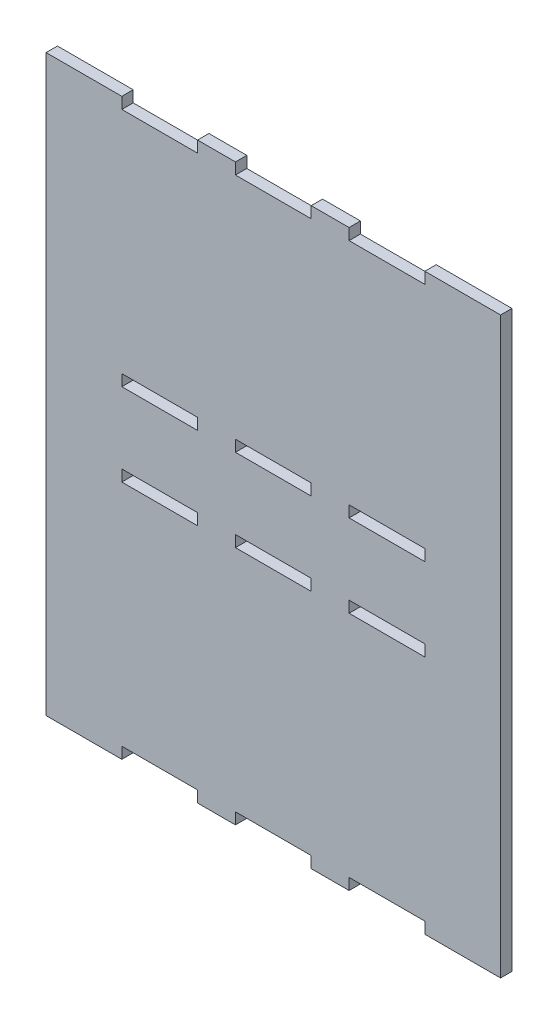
ISO-10303-21;
HEADER;
FILE_DESCRIPTION(('STEP AP214'),'2;1');
FILE_NAME('part.step','',(''),(''),'','','');
FILE_SCHEMA(('AUTOMOTIVE_DESIGN { 1 0 10303 214 1 1 1 1 }'));
ENDSEC;
DATA;
#1=APPLICATION_CONTEXT('core data for automotive mechanical design processes');
#2=APPLICATION_PROTOCOL_DEFINITION('international standard','automotive_design',2000,#1);
#3=PRODUCT_CONTEXT('',#1,'mechanical');
#4=PRODUCT('Part','Part','',(#3));
#5=PRODUCT_RELATED_PRODUCT_CATEGORY('part','',(#4));
#6=PRODUCT_DEFINITION_FORMATION('','',#4);
#7=PRODUCT_DEFINITION_CONTEXT('part definition',#1,'design');
#8=PRODUCT_DEFINITION('design','',#6,#7);
#9=PRODUCT_DEFINITION_SHAPE('','',#8);
#10=(LENGTH_UNIT() NAMED_UNIT(*) SI_UNIT(.MILLI.,.METRE.));
#11=(NAMED_UNIT(*) PLANE_ANGLE_UNIT() SI_UNIT($,.RADIAN.));
#12=(NAMED_UNIT(*) SI_UNIT($,.STERADIAN.) SOLID_ANGLE_UNIT());
#13=UNCERTAINTY_MEASURE_WITH_UNIT(LENGTH_MEASURE(1.E-05),#10,'distance_accuracy_value','');
#14=(GEOMETRIC_REPRESENTATION_CONTEXT(3) GLOBAL_UNCERTAINTY_ASSIGNED_CONTEXT((#13)) GLOBAL_UNIT_ASSIGNED_CONTEXT((#10,
#11,#12)) REPRESENTATION_CONTEXT('',''));
#15=CARTESIAN_POINT('',(0.,0.,0.));
#16=DIRECTION('',(0.,0.,1.));
#17=DIRECTION('',(1.,0.,0.));
#18=AXIS2_PLACEMENT_3D('',#15,#16,#17);
#19=CARTESIAN_POINT('',(0.,-85.2,3.));
#20=DIRECTION('',(0.,1.,0.));
#21=DIRECTION('',(0.,0.,1.));
#22=AXIS2_PLACEMENT_3D('',#19,#20,#21);
#23=PLANE('',#22);
#24=DIRECTION('',(1.,0.,0.));
#25=VECTOR('',#24,1.);
#26=CARTESIAN_POINT('',(0.,-85.2,0.));
#27=LINE('',#26,#25);
#28=CARTESIAN_POINT('',(-40.,-85.2,0.));
#29=VERTEX_POINT('',#28);
#30=CARTESIAN_POINT('',(-20.,-85.2,0.));
#31=VERTEX_POINT('',#30);
#32=EDGE_CURVE('E654',#29,#31,#27,.T.);
#33=ORIENTED_EDGE('',*,*,#32,.F.);
#34=DIRECTION('',(0.,0.,-1.));
#35=VECTOR('',#34,1.);
#36=CARTESIAN_POINT('',(-40.,-85.2,3.));
#37=LINE('',#36,#35);
#38=CARTESIAN_POINT('',(-40.,-85.2,3.));
#39=VERTEX_POINT('',#38);
#40=EDGE_CURVE('E11',#39,#29,#37,.T.);
#41=ORIENTED_EDGE('',*,*,#40,.F.);
#42=DIRECTION('',(1.,0.,0.));
#43=VECTOR('',#42,1.);
#44=CARTESIAN_POINT('',(0.,-85.2,3.));
#45=LINE('',#44,#43);
#46=CARTESIAN_POINT('',(-20.,-85.2,3.));
#47=VERTEX_POINT('',#46);
#48=EDGE_CURVE('E387',#39,#47,#45,.T.);
#49=ORIENTED_EDGE('',*,*,#48,.T.);
#50=DIRECTION('',(0.,0.,-1.));
#51=VECTOR('',#50,1.);
#52=CARTESIAN_POINT('',(-20.,-85.2,3.));
#53=LINE('',#52,#51);
#54=EDGE_CURVE('E57',#47,#31,#53,.T.);
#55=ORIENTED_EDGE('',*,*,#54,.T.);
#56=EDGE_LOOP('',(#33,#41,#49,#55));
#57=FACE_BOUND('',#56,.T.);
#58=ADVANCED_FACE('F38',(#57),#23,.T.);
#59=CARTESIAN_POINT('',(-40.,0.,3.));
#60=DIRECTION('',(-1.,0.,0.));
#61=DIRECTION('',(0.,0.,1.));
#62=AXIS2_PLACEMENT_3D('',#59,#60,#61);
#63=PLANE('',#62);
#64=DIRECTION('',(0.,1.,0.));
#65=VECTOR('',#64,1.);
#66=CARTESIAN_POINT('',(-40.,0.,0.));
#67=LINE('',#66,#65);
#68=CARTESIAN_POINT('',(-40.,-82.2,0.));
#69=VERTEX_POINT('',#68);
#70=EDGE_CURVE('E392',#29,#69,#67,.T.);
#71=ORIENTED_EDGE('',*,*,#70,.T.);
#72=DIRECTION('',(0.,0.,-1.));
#73=VECTOR('',#72,1.);
#74=CARTESIAN_POINT('',(-40.,-82.2,3.));
#75=LINE('',#74,#73);
#76=CARTESIAN_POINT('',(-40.,-82.2,3.));
#77=VERTEX_POINT('',#76);
#78=EDGE_CURVE('E48',#77,#69,#75,.T.);
#79=ORIENTED_EDGE('',*,*,#78,.F.);
#80=DIRECTION('',(0.,1.,0.));
#81=VECTOR('',#80,1.);
#82=CARTESIAN_POINT('',(-40.,0.,3.));
#83=LINE('',#82,#81);
#84=EDGE_CURVE('E382',#39,#77,#83,.T.);
#85=ORIENTED_EDGE('',*,*,#84,.F.);
#86=ORIENTED_EDGE('',*,*,#40,.T.);
#87=EDGE_LOOP('',(#71,#79,#85,#86));
#88=FACE_BOUND('',#87,.T.);
#89=ADVANCED_FACE('F390',(#88),#63,.F.);
#90=CARTESIAN_POINT('',(-1.14075415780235E-13,-82.2000000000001,3.));
#91=DIRECTION('',(0.,1.,0.));
#92=DIRECTION('',(-1.,0.,0.));
#93=AXIS2_PLACEMENT_3D('',#90,#91,#92);
#94=PLANE('',#93);
#95=DIRECTION('',(1.,0.,0.));
#96=VECTOR('',#95,1.);
#97=CARTESIAN_POINT('',(-1.14075415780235E-13,-82.2000000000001,0.));
#98=LINE('',#97,#96);
#99=CARTESIAN_POINT('',(-20.,-82.2,0.));
#100=VERTEX_POINT('',#99);
#101=EDGE_CURVE('E657',#69,#100,#98,.T.);
#102=ORIENTED_EDGE('',*,*,#101,.T.);
#103=DIRECTION('',(0.,0.,-1.));
#104=VECTOR('',#103,1.);
#105=CARTESIAN_POINT('',(-20.,-82.2,3.));
#106=LINE('',#105,#104);
#107=CARTESIAN_POINT('',(-20.,-82.2,3.));
#108=VERTEX_POINT('',#107);
#109=EDGE_CURVE('E215',#108,#100,#106,.T.);
#110=ORIENTED_EDGE('',*,*,#109,.F.);
#111=DIRECTION('',(1.,0.,0.));
#112=VECTOR('',#111,1.);
#113=CARTESIAN_POINT('',(-1.14075415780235E-13,-82.2000000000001,3.));
#114=LINE('',#113,#112);
#115=EDGE_CURVE('E374',#77,#108,#114,.T.);
#116=ORIENTED_EDGE('',*,*,#115,.F.);
#117=ORIENTED_EDGE('',*,*,#78,.T.);
#118=EDGE_LOOP('',(#102,#110,#116,#117));
#119=FACE_BOUND('',#118,.T.);
#120=ADVANCED_FACE('F376',(#119),#94,.F.);
#121=CARTESIAN_POINT('',(40.,0.,3.));
#122=DIRECTION('',(-1.,0.,0.));
#123=DIRECTION('',(0.,0.,1.));
#124=AXIS2_PLACEMENT_3D('',#121,#122,#123);
#125=PLANE('',#124);
#126=DIRECTION('',(0.,1.,0.));
#127=VECTOR('',#126,1.);
#128=CARTESIAN_POINT('',(40.,0.,0.));
#129=LINE('',#128,#127);
#130=CARTESIAN_POINT('',(40.,-85.2,0.));
#131=VERTEX_POINT('',#130);
#132=CARTESIAN_POINT('',(40.,-82.2,0.));
#133=VERTEX_POINT('',#132);
#134=EDGE_CURVE('E642',#131,#133,#129,.T.);
#135=ORIENTED_EDGE('',*,*,#134,.F.);
#136=DIRECTION('',(0.,0.,-1.));
#137=VECTOR('',#136,1.);
#138=CARTESIAN_POINT('',(40.,-85.2,3.));
#139=LINE('',#138,#137);
#140=CARTESIAN_POINT('',(40.,-85.2,3.));
#141=VERTEX_POINT('',#140);
#142=EDGE_CURVE('E405',#141,#131,#139,.T.);
#143=ORIENTED_EDGE('',*,*,#142,.F.);
#144=DIRECTION('',(0.,1.,0.));
#145=VECTOR('',#144,1.);
#146=CARTESIAN_POINT('',(40.,0.,3.));
#147=LINE('',#146,#145);
#148=CARTESIAN_POINT('',(40.,-82.2,3.));
#149=VERTEX_POINT('',#148);
#150=EDGE_CURVE('E777',#141,#149,#147,.T.);
#151=ORIENTED_EDGE('',*,*,#150,.T.);
#152=DIRECTION('',(0.,0.,-1.));
#153=VECTOR('',#152,1.);
#154=CARTESIAN_POINT('',(40.,-82.2,3.));
#155=LINE('',#154,#153);
#156=EDGE_CURVE('E397',#149,#133,#155,.T.);
#157=ORIENTED_EDGE('',*,*,#156,.T.);
#158=EDGE_LOOP('',(#135,#143,#151,#157));
#159=FACE_BOUND('',#158,.T.);
#160=ADVANCED_FACE('F824',(#159),#125,.T.);
#161=CARTESIAN_POINT('',(0.,-85.2,3.));
#162=DIRECTION('',(0.,-1.,0.));
#163=DIRECTION('',(0.,0.,-1.));
#164=AXIS2_PLACEMENT_3D('',#161,#162,#163);
#165=PLANE('',#164);
#166=DIRECTION('',(-1.,0.,0.));
#167=VECTOR('',#166,1.);
#168=CARTESIAN_POINT('',(0.,-85.2,0.));
#169=LINE('',#168,#167);
#170=CARTESIAN_POINT('',(20.,-85.2,0.));
#171=VERTEX_POINT('',#170);
#172=EDGE_CURVE('E645',#131,#171,#169,.T.);
#173=ORIENTED_EDGE('',*,*,#172,.T.);
#174=DIRECTION('',(0.,0.,-1.));
#175=VECTOR('',#174,1.);
#176=CARTESIAN_POINT('',(20.,-85.2,3.));
#177=LINE('',#176,#175);
#178=CARTESIAN_POINT('',(20.,-85.2,3.));
#179=VERTEX_POINT('',#178);
#180=EDGE_CURVE('E402',#179,#171,#177,.T.);
#181=ORIENTED_EDGE('',*,*,#180,.F.);
#182=DIRECTION('',(-1.,0.,0.));
#183=VECTOR('',#182,1.);
#184=CARTESIAN_POINT('',(0.,-85.2,3.));
#185=LINE('',#184,#183);
#186=EDGE_CURVE('E780',#141,#179,#185,.T.);
#187=ORIENTED_EDGE('',*,*,#186,.F.);
#188=ORIENTED_EDGE('',*,*,#142,.T.);
#189=EDGE_LOOP('',(#173,#181,#187,#188));
#190=FACE_BOUND('',#189,.T.);
#191=ADVANCED_FACE('F820',(#190),#165,.F.);
#192=CARTESIAN_POINT('',(20.0000000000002,0.,3.));
#193=DIRECTION('',(-1.,0.,0.));
#194=DIRECTION('',(0.,-1.,0.));
#195=AXIS2_PLACEMENT_3D('',#192,#193,#194);
#196=PLANE('',#195);
#197=DIRECTION('',(0.,1.,0.));
#198=VECTOR('',#197,1.);
#199=CARTESIAN_POINT('',(20.0000000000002,0.,0.));
#200=LINE('',#199,#198);
#201=CARTESIAN_POINT('',(20.,-82.2,0.));
#202=VERTEX_POINT('',#201);
#203=EDGE_CURVE('E648',#171,#202,#200,.T.);
#204=ORIENTED_EDGE('',*,*,#203,.T.);
#205=DIRECTION('',(0.,0.,-1.));
#206=VECTOR('',#205,1.);
#207=CARTESIAN_POINT('',(20.,-82.2,3.));
#208=LINE('',#207,#206);
#209=CARTESIAN_POINT('',(20.,-82.2,3.));
#210=VERTEX_POINT('',#209);
#211=EDGE_CURVE('E399',#210,#202,#208,.T.);
#212=ORIENTED_EDGE('',*,*,#211,.F.);
#213=DIRECTION('',(0.,1.,0.));
#214=VECTOR('',#213,1.);
#215=CARTESIAN_POINT('',(20.0000000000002,0.,3.));
#216=LINE('',#215,#214);
#217=EDGE_CURVE('E783',#179,#210,#216,.T.);
#218=ORIENTED_EDGE('',*,*,#217,.F.);
#219=ORIENTED_EDGE('',*,*,#180,.T.);
#220=EDGE_LOOP('',(#204,#212,#218,#219));
#221=FACE_BOUND('',#220,.T.);
#222=ADVANCED_FACE('F816',(#221),#196,.F.);
#223=CARTESIAN_POINT('',(0.,-60.4,3.));
#224=DIRECTION('',(0.,-1.,0.));
#225=DIRECTION('',(1.,0.,0.));
#226=AXIS2_PLACEMENT_3D('',#223,#224,#225);
#227=PLANE('',#226);
#228=DIRECTION('',(-1.,0.,0.));
#229=VECTOR('',#228,1.);
#230=CARTESIAN_POINT('',(0.,-60.4,0.));
#231=LINE('',#230,#229);
#232=CARTESIAN_POINT('',(40.,-60.4,0.));
#233=VERTEX_POINT('',#232);
#234=CARTESIAN_POINT('',(20.,-60.4,0.));
#235=VERTEX_POINT('',#234);
#236=EDGE_CURVE('E630',#233,#235,#231,.T.);
#237=ORIENTED_EDGE('',*,*,#236,.F.);
#238=DIRECTION('',(0.,0.,-1.));
#239=VECTOR('',#238,1.);
#240=CARTESIAN_POINT('',(40.,-60.4,3.));
#241=LINE('',#240,#239);
#242=CARTESIAN_POINT('',(40.,-60.4,3.));
#243=VERTEX_POINT('',#242);
#244=EDGE_CURVE('E400',#243,#233,#241,.T.);
#245=ORIENTED_EDGE('',*,*,#244,.F.);
#246=DIRECTION('',(-1.,0.,0.));
#247=VECTOR('',#246,1.);
#248=CARTESIAN_POINT('',(0.,-60.4,3.));
#249=LINE('',#248,#247);
#250=CARTESIAN_POINT('',(20.,-60.4,3.));
#251=VERTEX_POINT('',#250);
#252=EDGE_CURVE('E766',#243,#251,#249,.T.);
#253=ORIENTED_EDGE('',*,*,#252,.T.);
#254=DIRECTION('',(0.,0.,-1.));
#255=VECTOR('',#254,1.);
#256=CARTESIAN_POINT('',(20.,-60.4,3.));
#257=LINE('',#256,#255);
#258=EDGE_CURVE('E407',#251,#235,#257,.T.);
#259=ORIENTED_EDGE('',*,*,#258,.T.);
#260=EDGE_LOOP('',(#237,#245,#253,#259));
#261=FACE_BOUND('',#260,.T.);
#262=ADVANCED_FACE('F819',(#261),#227,.T.);
#263=CARTESIAN_POINT('',(40.,0.,3.));
#264=DIRECTION('',(1.,0.,0.));
#265=DIRECTION('',(0.,0.,-1.));
#266=AXIS2_PLACEMENT_3D('',#263,#264,#265);
#267=PLANE('',#266);
#268=DIRECTION('',(0.,-1.,0.));
#269=VECTOR('',#268,1.);
#270=CARTESIAN_POINT('',(40.,0.,0.));
#271=LINE('',#270,#269);
#272=CARTESIAN_POINT('',(40.,-63.4,0.));
#273=VERTEX_POINT('',#272);
#274=EDGE_CURVE('E633',#233,#273,#271,.T.);
#275=ORIENTED_EDGE('',*,*,#274,.T.);
#276=DIRECTION('',(0.,0.,-1.));
#277=VECTOR('',#276,1.);
#278=CARTESIAN_POINT('',(40.,-63.4,3.));
#279=LINE('',#278,#277);
#280=CARTESIAN_POINT('',(40.,-63.4,3.));
#281=VERTEX_POINT('',#280);
#282=EDGE_CURVE('E412',#281,#273,#279,.T.);
#283=ORIENTED_EDGE('',*,*,#282,.F.);
#284=DIRECTION('',(0.,-1.,0.));
#285=VECTOR('',#284,1.);
#286=CARTESIAN_POINT('',(40.,0.,3.));
#287=LINE('',#286,#285);
#288=EDGE_CURVE('E769',#243,#281,#287,.T.);
#289=ORIENTED_EDGE('',*,*,#288,.F.);
#290=ORIENTED_EDGE('',*,*,#244,.T.);
#291=EDGE_LOOP('',(#275,#283,#289,#290));
#292=FACE_BOUND('',#291,.T.);
#293=ADVANCED_FACE('F837',(#292),#267,.F.);
#294=CARTESIAN_POINT('',(0.,-63.4,3.));
#295=DIRECTION('',(0.,-1.,0.));
#296=DIRECTION('',(1.,0.,0.));
#297=AXIS2_PLACEMENT_3D('',#294,#295,#296);
#298=PLANE('',#297);
#299=DIRECTION('',(-1.,0.,0.));
#300=VECTOR('',#299,1.);
#301=CARTESIAN_POINT('',(0.,-63.4,0.));
#302=LINE('',#301,#300);
#303=CARTESIAN_POINT('',(20.,-63.4,0.));
#304=VERTEX_POINT('',#303);
#305=EDGE_CURVE('E636',#273,#304,#302,.T.);
#306=ORIENTED_EDGE('',*,*,#305,.T.);
#307=DIRECTION('',(0.,0.,-1.));
#308=VECTOR('',#307,1.);
#309=CARTESIAN_POINT('',(20.,-63.4,3.));
#310=LINE('',#309,#308);
#311=CARTESIAN_POINT('',(20.,-63.4,3.));
#312=VERTEX_POINT('',#311);
#313=EDGE_CURVE('E409',#312,#304,#310,.T.);
#314=ORIENTED_EDGE('',*,*,#313,.F.);
#315=DIRECTION('',(-1.,0.,0.));
#316=VECTOR('',#315,1.);
#317=CARTESIAN_POINT('',(0.,-63.4,3.));
#318=LINE('',#317,#316);
#319=EDGE_CURVE('E772',#281,#312,#318,.T.);
#320=ORIENTED_EDGE('',*,*,#319,.F.);
#321=ORIENTED_EDGE('',*,*,#282,.T.);
#322=EDGE_LOOP('',(#306,#314,#320,#321));
#323=FACE_BOUND('',#322,.T.);
#324=ADVANCED_FACE('F833',(#323),#298,.F.);
#325=CARTESIAN_POINT('',(0.,-60.4,3.));
#326=DIRECTION('',(0.,1.,0.));
#327=DIRECTION('',(0.,0.,1.));
#328=AXIS2_PLACEMENT_3D('',#325,#326,#327);
#329=PLANE('',#328);
#330=DIRECTION('',(1.,0.,0.));
#331=VECTOR('',#330,1.);
#332=CARTESIAN_POINT('',(0.,-60.4,0.));
#333=LINE('',#332,#331);
#334=CARTESIAN_POINT('',(-40.,-60.4,0.));
#335=VERTEX_POINT('',#334);
#336=CARTESIAN_POINT('',(-20.,-60.4,0.));
#337=VERTEX_POINT('',#336);
#338=EDGE_CURVE('E618',#335,#337,#333,.T.);
#339=ORIENTED_EDGE('',*,*,#338,.T.);
#340=DIRECTION('',(0.,0.,-1.));
#341=VECTOR('',#340,1.);
#342=CARTESIAN_POINT('',(-20.,-60.4,3.));
#343=LINE('',#342,#341);
#344=CARTESIAN_POINT('',(-20.,-60.4,3.));
#345=VERTEX_POINT('',#344);
#346=EDGE_CURVE('E410',#345,#337,#343,.T.);
#347=ORIENTED_EDGE('',*,*,#346,.F.);
#348=DIRECTION('',(1.,0.,0.));
#349=VECTOR('',#348,1.);
#350=CARTESIAN_POINT('',(0.,-60.4,3.));
#351=LINE('',#350,#349);
#352=CARTESIAN_POINT('',(-40.,-60.4,3.));
#353=VERTEX_POINT('',#352);
#354=EDGE_CURVE('E755',#353,#345,#351,.T.);
#355=ORIENTED_EDGE('',*,*,#354,.F.);
#356=DIRECTION('',(0.,0.,-1.));
#357=VECTOR('',#356,1.);
#358=CARTESIAN_POINT('',(-40.,-60.4,3.));
#359=LINE('',#358,#357);
#360=EDGE_CURVE('E416',#353,#335,#359,.T.);
#361=ORIENTED_EDGE('',*,*,#360,.T.);
#362=EDGE_LOOP('',(#339,#347,#355,#361));
#363=FACE_BOUND('',#362,.T.);
#364=ADVANCED_FACE('F836',(#363),#329,.F.);
#365=CARTESIAN_POINT('',(-20.,0.,3.));
#366=DIRECTION('',(1.,0.,0.));
#367=DIRECTION('',(0.,0.,-1.));
#368=AXIS2_PLACEMENT_3D('',#365,#366,#367);
#369=PLANE('',#368);
#370=DIRECTION('',(0.,-1.,0.));
#371=VECTOR('',#370,1.);
#372=CARTESIAN_POINT('',(-20.,0.,0.));
#373=LINE('',#372,#371);
#374=CARTESIAN_POINT('',(-20.,-63.4,0.));
#375=VERTEX_POINT('',#374);
#376=EDGE_CURVE('E621',#337,#375,#373,.T.);
#377=ORIENTED_EDGE('',*,*,#376,.T.);
#378=DIRECTION('',(0.,0.,-1.));
#379=VECTOR('',#378,1.);
#380=CARTESIAN_POINT('',(-20.,-63.4,3.));
#381=LINE('',#380,#379);
#382=CARTESIAN_POINT('',(-20.,-63.4,3.));
#383=VERTEX_POINT('',#382);
#384=EDGE_CURVE('E421',#383,#375,#381,.T.);
#385=ORIENTED_EDGE('',*,*,#384,.F.);
#386=DIRECTION('',(0.,-1.,0.));
#387=VECTOR('',#386,1.);
#388=CARTESIAN_POINT('',(-20.,0.,3.));
#389=LINE('',#388,#387);
#390=EDGE_CURVE('E758',#345,#383,#389,.T.);
#391=ORIENTED_EDGE('',*,*,#390,.F.);
#392=ORIENTED_EDGE('',*,*,#346,.T.);
#393=EDGE_LOOP('',(#377,#385,#391,#392));
#394=FACE_BOUND('',#393,.T.);
#395=ADVANCED_FACE('F853',(#394),#369,.F.);
#396=CARTESIAN_POINT('',(0.,-63.4,3.));
#397=DIRECTION('',(0.,1.,0.));
#398=DIRECTION('',(-1.,0.,0.));
#399=AXIS2_PLACEMENT_3D('',#396,#397,#398);
#400=PLANE('',#399);
#401=DIRECTION('',(1.,0.,0.));
#402=VECTOR('',#401,1.);
#403=CARTESIAN_POINT('',(0.,-63.4,0.));
#404=LINE('',#403,#402);
#405=CARTESIAN_POINT('',(-40.,-63.4,0.));
#406=VERTEX_POINT('',#405);
#407=EDGE_CURVE('E624',#406,#375,#404,.T.);
#408=ORIENTED_EDGE('',*,*,#407,.F.);
#409=DIRECTION('',(0.,0.,-1.));
#410=VECTOR('',#409,1.);
#411=CARTESIAN_POINT('',(-40.,-63.4,3.));
#412=LINE('',#411,#410);
#413=CARTESIAN_POINT('',(-40.,-63.4,3.));
#414=VERTEX_POINT('',#413);
#415=EDGE_CURVE('E418',#414,#406,#412,.T.);
#416=ORIENTED_EDGE('',*,*,#415,.F.);
#417=DIRECTION('',(1.,0.,0.));
#418=VECTOR('',#417,1.);
#419=CARTESIAN_POINT('',(0.,-63.4,3.));
#420=LINE('',#419,#418);
#421=EDGE_CURVE('E760',#414,#383,#420,.T.);
#422=ORIENTED_EDGE('',*,*,#421,.T.);
#423=ORIENTED_EDGE('',*,*,#384,.T.);
#424=EDGE_LOOP('',(#408,#416,#422,#423));
#425=FACE_BOUND('',#424,.T.);
#426=ADVANCED_FACE('F849',(#425),#400,.T.);
#427=CARTESIAN_POINT('',(10.,0.,3.));
#428=DIRECTION('',(-1.,0.,0.));
#429=DIRECTION('',(0.,0.,1.));
#430=AXIS2_PLACEMENT_3D('',#427,#428,#429);
#431=PLANE('',#430);
#432=DIRECTION('',(0.,1.,0.));
#433=VECTOR('',#432,1.);
#434=CARTESIAN_POINT('',(10.,0.,0.));
#435=LINE('',#434,#433);
#436=CARTESIAN_POINT('',(10.,-63.4,0.));
#437=VERTEX_POINT('',#436);
#438=CARTESIAN_POINT('',(10.,-60.4,0.));
#439=VERTEX_POINT('',#438);
#440=EDGE_CURVE('E606',#437,#439,#435,.T.);
#441=ORIENTED_EDGE('',*,*,#440,.F.);
#442=DIRECTION('',(0.,0.,-1.));
#443=VECTOR('',#442,1.);
#444=CARTESIAN_POINT('',(10.,-63.4,3.));
#445=LINE('',#444,#443);
#446=CARTESIAN_POINT('',(10.,-63.4,3.));
#447=VERTEX_POINT('',#446);
#448=EDGE_CURVE('E419',#447,#437,#445,.T.);
#449=ORIENTED_EDGE('',*,*,#448,.F.);
#450=DIRECTION('',(0.,1.,0.));
#451=VECTOR('',#450,1.);
#452=CARTESIAN_POINT('',(10.,0.,3.));
#453=LINE('',#452,#451);
#454=CARTESIAN_POINT('',(10.,-60.4,3.));
#455=VERTEX_POINT('',#454);
#456=EDGE_CURVE('E744',#447,#455,#453,.T.);
#457=ORIENTED_EDGE('',*,*,#456,.T.);
#458=DIRECTION('',(0.,0.,-1.));
#459=VECTOR('',#458,1.);
#460=CARTESIAN_POINT('',(10.,-60.4,3.));
#461=LINE('',#460,#459);
#462=EDGE_CURVE('E425',#455,#439,#461,.T.);
#463=ORIENTED_EDGE('',*,*,#462,.T.);
#464=EDGE_LOOP('',(#441,#449,#457,#463));
#465=FACE_BOUND('',#464,.T.);
#466=ADVANCED_FACE('F852',(#465),#431,.T.);
#467=CARTESIAN_POINT('',(0.,-63.4,3.));
#468=DIRECTION('',(0.,-1.,0.));
#469=DIRECTION('',(0.,0.,-1.));
#470=AXIS2_PLACEMENT_3D('',#467,#468,#469);
#471=PLANE('',#470);
#472=DIRECTION('',(-1.,0.,0.));
#473=VECTOR('',#472,1.);
#474=CARTESIAN_POINT('',(0.,-63.4,0.));
#475=LINE('',#474,#473);
#476=CARTESIAN_POINT('',(-10.,-63.4,0.));
#477=VERTEX_POINT('',#476);
#478=EDGE_CURVE('E609',#437,#477,#475,.T.);
#479=ORIENTED_EDGE('',*,*,#478,.T.);
#480=DIRECTION('',(0.,0.,-1.));
#481=VECTOR('',#480,1.);
#482=CARTESIAN_POINT('',(-10.,-63.4,3.));
#483=LINE('',#482,#481);
#484=CARTESIAN_POINT('',(-10.,-63.4,3.));
#485=VERTEX_POINT('',#484);
#486=EDGE_CURVE('E431',#485,#477,#483,.T.);
#487=ORIENTED_EDGE('',*,*,#486,.F.);
#488=DIRECTION('',(-1.,0.,0.));
#489=VECTOR('',#488,1.);
#490=CARTESIAN_POINT('',(0.,-63.4,3.));
#491=LINE('',#490,#489);
#492=EDGE_CURVE('E747',#447,#485,#491,.T.);
#493=ORIENTED_EDGE('',*,*,#492,.F.);
#494=ORIENTED_EDGE('',*,*,#448,.T.);
#495=EDGE_LOOP('',(#479,#487,#493,#494));
#496=FACE_BOUND('',#495,.T.);
#497=ADVANCED_FACE('F868',(#496),#471,.F.);
#498=CARTESIAN_POINT('',(-10.,0.,3.));
#499=DIRECTION('',(-1.,0.,0.));
#500=DIRECTION('',(0.,0.,1.));
#501=AXIS2_PLACEMENT_3D('',#498,#499,#500);
#502=PLANE('',#501);
#503=DIRECTION('',(0.,1.,0.));
#504=VECTOR('',#503,1.);
#505=CARTESIAN_POINT('',(-10.,0.,0.));
#506=LINE('',#505,#504);
#507=CARTESIAN_POINT('',(-10.,-60.4,0.));
#508=VERTEX_POINT('',#507);
#509=EDGE_CURVE('E612',#477,#508,#506,.T.);
#510=ORIENTED_EDGE('',*,*,#509,.T.);
#511=DIRECTION('',(0.,0.,-1.));
#512=VECTOR('',#511,1.);
#513=CARTESIAN_POINT('',(-10.,-60.4,3.));
#514=LINE('',#513,#512);
#515=CARTESIAN_POINT('',(-10.,-60.4,3.));
#516=VERTEX_POINT('',#515);
#517=EDGE_CURVE('E427',#516,#508,#514,.T.);
#518=ORIENTED_EDGE('',*,*,#517,.F.);
#519=DIRECTION('',(0.,1.,0.));
#520=VECTOR('',#519,1.);
#521=CARTESIAN_POINT('',(-10.,0.,3.));
#522=LINE('',#521,#520);
#523=EDGE_CURVE('E750',#485,#516,#522,.T.);
#524=ORIENTED_EDGE('',*,*,#523,.F.);
#525=ORIENTED_EDGE('',*,*,#486,.T.);
#526=EDGE_LOOP('',(#510,#518,#524,#525));
#527=FACE_BOUND('',#526,.T.);
#528=ADVANCED_FACE('F864',(#527),#502,.F.);
#529=CARTESIAN_POINT('',(40.0000000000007,-1.85037170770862E-13,3.));
#530=DIRECTION('',(1.,0.,0.));
#531=DIRECTION('',(0.,1.,0.));
#532=AXIS2_PLACEMENT_3D('',#529,#530,#531);
#533=PLANE('',#532);
#534=DIRECTION('',(0.,-1.,0.));
#535=VECTOR('',#534,1.);
#536=CARTESIAN_POINT('',(40.0000000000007,-1.85037170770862E-13,0.));
#537=LINE('',#536,#535);
#538=CARTESIAN_POINT('',(40.,-145.6,0.));
#539=VERTEX_POINT('',#538);
#540=CARTESIAN_POINT('',(40.,-148.6,0.));
#541=VERTEX_POINT('',#540);
#542=EDGE_CURVE('E532',#539,#541,#537,.T.);
#543=ORIENTED_EDGE('',*,*,#542,.T.);
#544=DIRECTION('',(0.,0.,-1.));
#545=VECTOR('',#544,1.);
#546=CARTESIAN_POINT('',(40.,-148.6,3.));
#547=LINE('',#546,#545);
#548=CARTESIAN_POINT('',(40.,-148.6,3.));
#549=VERTEX_POINT('',#548);
#550=EDGE_CURVE('E428',#549,#541,#547,.T.);
#551=ORIENTED_EDGE('',*,*,#550,.F.);
#552=DIRECTION('',(0.,-1.,0.));
#553=VECTOR('',#552,1.);
#554=CARTESIAN_POINT('',(40.0000000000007,-1.85037170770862E-13,3.));
#555=LINE('',#554,#553);
#556=CARTESIAN_POINT('',(40.,-145.6,3.));
#557=VERTEX_POINT('',#556);
#558=EDGE_CURVE('E672',#557,#549,#555,.T.);
#559=ORIENTED_EDGE('',*,*,#558,.F.);
#560=DIRECTION('',(0.,0.,-1.));
#561=VECTOR('',#560,1.);
#562=CARTESIAN_POINT('',(40.,-145.6,3.));
#563=LINE('',#562,#561);
#564=EDGE_CURVE('E435',#557,#539,#563,.T.);
#565=ORIENTED_EDGE('',*,*,#564,.T.);
#566=EDGE_LOOP('',(#543,#551,#559,#565));
#567=FACE_BOUND('',#566,.T.);
#568=ADVANCED_FACE('F867',(#567),#533,.F.);
#569=CARTESIAN_POINT('',(0.,-148.6,3.));
#570=DIRECTION('',(0.,1.,0.));
#571=DIRECTION('',(0.,0.,1.));
#572=AXIS2_PLACEMENT_3D('',#569,#570,#571);
#573=PLANE('',#572);
#574=DIRECTION('',(1.,0.,0.));
#575=VECTOR('',#574,1.);
#576=CARTESIAN_POINT('',(0.,-148.6,0.));
#577=LINE('',#576,#575);
#578=CARTESIAN_POINT('',(60.,-148.6,0.));
#579=VERTEX_POINT('',#578);
#580=EDGE_CURVE('E535',#541,#579,#577,.T.);
#581=ORIENTED_EDGE('',*,*,#580,.T.);
#582=DIRECTION('',(0.,0.,-1.));
#583=VECTOR('',#582,1.);
#584=CARTESIAN_POINT('',(60.,-148.6,3.));
#585=LINE('',#584,#583);
#586=CARTESIAN_POINT('',(60.,-148.6,3.));
#587=VERTEX_POINT('',#586);
#588=EDGE_CURVE('E497',#587,#579,#585,.T.);
#589=ORIENTED_EDGE('',*,*,#588,.F.);
#590=DIRECTION('',(1.,0.,0.));
#591=VECTOR('',#590,1.);
#592=CARTESIAN_POINT('',(0.,-148.6,3.));
#593=LINE('',#592,#591);
#594=EDGE_CURVE('E675',#549,#587,#593,.T.);
#595=ORIENTED_EDGE('',*,*,#594,.F.);
#596=ORIENTED_EDGE('',*,*,#550,.T.);
#597=EDGE_LOOP('',(#581,#589,#595,#596));
#598=FACE_BOUND('',#597,.T.);
#599=ADVANCED_FACE('F978',(#598),#573,.F.);
#600=CARTESIAN_POINT('',(60.,0.,3.));
#601=DIRECTION('',(1.,0.,0.));
#602=DIRECTION('',(0.,0.,-1.));
#603=AXIS2_PLACEMENT_3D('',#600,#601,#602);
#604=PLANE('',#603);
#605=DIRECTION('',(0.,-1.,0.));
#606=VECTOR('',#605,1.);
#607=CARTESIAN_POINT('',(60.,0.,0.));
#608=LINE('',#607,#606);
#609=CARTESIAN_POINT('',(60.,3.,0.));
#610=VERTEX_POINT('',#609);
#611=EDGE_CURVE('E538',#610,#579,#608,.T.);
#612=ORIENTED_EDGE('',*,*,#611,.F.);
#613=DIRECTION('',(0.,0.,-1.));
#614=VECTOR('',#613,1.);
#615=CARTESIAN_POINT('',(60.,3.,3.));
#616=LINE('',#615,#614);
#617=CARTESIAN_POINT('',(60.,3.,3.));
#618=VERTEX_POINT('',#617);
#619=EDGE_CURVE('E495',#618,#610,#616,.T.);
#620=ORIENTED_EDGE('',*,*,#619,.F.);
#621=DIRECTION('',(0.,-1.,0.));
#622=VECTOR('',#621,1.);
#623=CARTESIAN_POINT('',(60.,0.,3.));
#624=LINE('',#623,#622);
#625=EDGE_CURVE('E677',#618,#587,#624,.T.);
#626=ORIENTED_EDGE('',*,*,#625,.T.);
#627=ORIENTED_EDGE('',*,*,#588,.T.);
#628=EDGE_LOOP('',(#612,#620,#626,#627));
#629=FACE_BOUND('',#628,.T.);
#630=ADVANCED_FACE('F974',(#629),#604,.T.);
#631=CARTESIAN_POINT('',(0.,3.,3.));
#632=DIRECTION('',(0.,1.,0.));
#633=DIRECTION('',(-1.,0.,0.));
#634=AXIS2_PLACEMENT_3D('',#631,#632,#633);
#635=PLANE('',#634);
#636=DIRECTION('',(1.,0.,0.));
#637=VECTOR('',#636,1.);
#638=CARTESIAN_POINT('',(0.,3.,0.));
#639=LINE('',#638,#637);
#640=CARTESIAN_POINT('',(40.,3.,0.));
#641=VERTEX_POINT('',#640);
#642=EDGE_CURVE('E541',#641,#610,#639,.T.);
#643=ORIENTED_EDGE('',*,*,#642,.F.);
#644=DIRECTION('',(0.,0.,-1.));
#645=VECTOR('',#644,1.);
#646=CARTESIAN_POINT('',(40.,3.,3.));
#647=LINE('',#646,#645);
#648=CARTESIAN_POINT('',(40.,3.,3.));
#649=VERTEX_POINT('',#648);
#650=EDGE_CURVE('E493',#649,#641,#647,.T.);
#651=ORIENTED_EDGE('',*,*,#650,.F.);
#652=DIRECTION('',(1.,0.,0.));
#653=VECTOR('',#652,1.);
#654=CARTESIAN_POINT('',(0.,3.,3.));
#655=LINE('',#654,#653);
#656=EDGE_CURVE('E680',#649,#618,#655,.T.);
#657=ORIENTED_EDGE('',*,*,#656,.T.);
#658=ORIENTED_EDGE('',*,*,#619,.T.);
#659=EDGE_LOOP('',(#643,#651,#657,#658));
#660=FACE_BOUND('',#659,.T.);
#661=ADVANCED_FACE('F970',(#660),#635,.T.);
#662=CARTESIAN_POINT('',(40.,0.,3.));
#663=DIRECTION('',(-1.,0.,0.));
#664=DIRECTION('',(0.,0.,1.));
#665=AXIS2_PLACEMENT_3D('',#662,#663,#664);
#666=PLANE('',#665);
#667=DIRECTION('',(0.,1.,0.));
#668=VECTOR('',#667,1.);
#669=CARTESIAN_POINT('',(40.,0.,0.));
#670=LINE('',#669,#668);
#671=CARTESIAN_POINT('',(40.,0.,0.));
#672=VERTEX_POINT('',#671);
#673=EDGE_CURVE('E544',#672,#641,#670,.T.);
#674=ORIENTED_EDGE('',*,*,#673,.F.);
#675=DIRECTION('',(0.,0.,-1.));
#676=VECTOR('',#675,1.);
#677=CARTESIAN_POINT('',(40.,0.,3.));
#678=LINE('',#677,#676);
#679=CARTESIAN_POINT('',(40.,0.,3.));
#680=VERTEX_POINT('',#679);
#681=EDGE_CURVE('E491',#680,#672,#678,.T.);
#682=ORIENTED_EDGE('',*,*,#681,.F.);
#683=DIRECTION('',(0.,1.,0.));
#684=VECTOR('',#683,1.);
#685=CARTESIAN_POINT('',(40.,0.,3.));
#686=LINE('',#685,#684);
#687=EDGE_CURVE('E683',#680,#649,#686,.T.);
#688=ORIENTED_EDGE('',*,*,#687,.T.);
#689=ORIENTED_EDGE('',*,*,#650,.T.);
#690=EDGE_LOOP('',(#674,#682,#688,#689));
#691=FACE_BOUND('',#690,.T.);
#692=ADVANCED_FACE('F966',(#691),#666,.T.);
#693=CARTESIAN_POINT('',(0.,0.,3.));
#694=DIRECTION('',(0.,1.,0.));
#695=DIRECTION('',(0.,0.,1.));
#696=AXIS2_PLACEMENT_3D('',#693,#694,#695);
#697=PLANE('',#696);
#698=DIRECTION('',(1.,0.,0.));
#699=VECTOR('',#698,1.);
#700=CARTESIAN_POINT('',(0.,0.,0.));
#701=LINE('',#700,#699);
#702=CARTESIAN_POINT('',(20.,0.,0.));
#703=VERTEX_POINT('',#702);
#704=EDGE_CURVE('E547',#703,#672,#701,.T.);
#705=ORIENTED_EDGE('',*,*,#704,.F.);
#706=DIRECTION('',(0.,0.,-1.));
#707=VECTOR('',#706,1.);
#708=CARTESIAN_POINT('',(20.,0.,3.));
#709=LINE('',#708,#707);
#710=CARTESIAN_POINT('',(20.,0.,3.));
#711=VERTEX_POINT('',#710);
#712=EDGE_CURVE('E489',#711,#703,#709,.T.);
#713=ORIENTED_EDGE('',*,*,#712,.F.);
#714=DIRECTION('',(1.,0.,0.));
#715=VECTOR('',#714,1.);
#716=CARTESIAN_POINT('',(0.,0.,3.));
#717=LINE('',#716,#715);
#718=EDGE_CURVE('E686',#711,#680,#717,.T.);
#719=ORIENTED_EDGE('',*,*,#718,.T.);
#720=ORIENTED_EDGE('',*,*,#681,.T.);
#721=EDGE_LOOP('',(#705,#713,#719,#720));
#722=FACE_BOUND('',#721,.T.);
#723=ADVANCED_FACE('F962',(#722),#697,.T.);
#724=CARTESIAN_POINT('',(20.,0.,3.));
#725=DIRECTION('',(1.,0.,0.));
#726=DIRECTION('',(0.,0.,-1.));
#727=AXIS2_PLACEMENT_3D('',#724,#725,#726);
#728=PLANE('',#727);
#729=DIRECTION('',(0.,-1.,0.));
#730=VECTOR('',#729,1.);
#731=CARTESIAN_POINT('',(20.,0.,0.));
#732=LINE('',#731,#730);
#733=CARTESIAN_POINT('',(20.,3.,0.));
#734=VERTEX_POINT('',#733);
#735=EDGE_CURVE('E550',#734,#703,#732,.T.);
#736=ORIENTED_EDGE('',*,*,#735,.F.);
#737=DIRECTION('',(0.,0.,-1.));
#738=VECTOR('',#737,1.);
#739=CARTESIAN_POINT('',(20.,3.,3.));
#740=LINE('',#739,#738);
#741=CARTESIAN_POINT('',(20.,3.,3.));
#742=VERTEX_POINT('',#741);
#743=EDGE_CURVE('E487',#742,#734,#740,.T.);
#744=ORIENTED_EDGE('',*,*,#743,.F.);
#745=DIRECTION('',(0.,-1.,0.));
#746=VECTOR('',#745,1.);
#747=CARTESIAN_POINT('',(20.,0.,3.));
#748=LINE('',#747,#746);
#749=EDGE_CURVE('E689',#742,#711,#748,.T.);
#750=ORIENTED_EDGE('',*,*,#749,.T.);
#751=ORIENTED_EDGE('',*,*,#712,.T.);
#752=EDGE_LOOP('',(#736,#744,#750,#751));
#753=FACE_BOUND('',#752,.T.);
#754=ADVANCED_FACE('F958',(#753),#728,.T.);
#755=CARTESIAN_POINT('',(0.,3.,3.));
#756=DIRECTION('',(0.,1.,0.));
#757=DIRECTION('',(0.,0.,1.));
#758=AXIS2_PLACEMENT_3D('',#755,#756,#757);
#759=PLANE('',#758);
#760=DIRECTION('',(1.,0.,0.));
#761=VECTOR('',#760,1.);
#762=CARTESIAN_POINT('',(0.,3.,0.));
#763=LINE('',#762,#761);
#764=CARTESIAN_POINT('',(10.,3.,0.));
#765=VERTEX_POINT('',#764);
#766=EDGE_CURVE('E553',#765,#734,#763,.T.);
#767=ORIENTED_EDGE('',*,*,#766,.F.);
#768=DIRECTION('',(0.,0.,-1.));
#769=VECTOR('',#768,1.);
#770=CARTESIAN_POINT('',(10.,3.,3.));
#771=LINE('',#770,#769);
#772=CARTESIAN_POINT('',(10.,3.,3.));
#773=VERTEX_POINT('',#772);
#774=EDGE_CURVE('E485',#773,#765,#771,.T.);
#775=ORIENTED_EDGE('',*,*,#774,.F.);
#776=DIRECTION('',(1.,0.,0.));
#777=VECTOR('',#776,1.);
#778=CARTESIAN_POINT('',(0.,3.,3.));
#779=LINE('',#778,#777);
#780=EDGE_CURVE('E692',#773,#742,#779,.T.);
#781=ORIENTED_EDGE('',*,*,#780,.T.);
#782=ORIENTED_EDGE('',*,*,#743,.T.);
#783=EDGE_LOOP('',(#767,#775,#781,#782));
#784=FACE_BOUND('',#783,.T.);
#785=ADVANCED_FACE('F954',(#784),#759,.T.);
#786=CARTESIAN_POINT('',(10.,0.,3.));
#787=DIRECTION('',(-1.,0.,0.));
#788=DIRECTION('',(0.,0.,1.));
#789=AXIS2_PLACEMENT_3D('',#786,#787,#788);
#790=PLANE('',#789);
#791=DIRECTION('',(0.,1.,0.));
#792=VECTOR('',#791,1.);
#793=CARTESIAN_POINT('',(10.,0.,0.));
#794=LINE('',#793,#792);
#795=CARTESIAN_POINT('',(10.,0.,0.));
#796=VERTEX_POINT('',#795);
#797=EDGE_CURVE('E556',#796,#765,#794,.T.);
#798=ORIENTED_EDGE('',*,*,#797,.F.);
#799=DIRECTION('',(0.,0.,-1.));
#800=VECTOR('',#799,1.);
#801=CARTESIAN_POINT('',(10.,0.,3.));
#802=LINE('',#801,#800);
#803=CARTESIAN_POINT('',(10.,0.,3.));
#804=VERTEX_POINT('',#803);
#805=EDGE_CURVE('E483',#804,#796,#802,.T.);
#806=ORIENTED_EDGE('',*,*,#805,.F.);
#807=DIRECTION('',(0.,1.,0.));
#808=VECTOR('',#807,1.);
#809=CARTESIAN_POINT('',(10.,0.,3.));
#810=LINE('',#809,#808);
#811=EDGE_CURVE('E695',#804,#773,#810,.T.);
#812=ORIENTED_EDGE('',*,*,#811,.T.);
#813=ORIENTED_EDGE('',*,*,#774,.T.);
#814=EDGE_LOOP('',(#798,#806,#812,#813));
#815=FACE_BOUND('',#814,.T.);
#816=ADVANCED_FACE('F950',(#815),#790,.T.);
#817=CARTESIAN_POINT('',(0.,0.,3.));
#818=DIRECTION('',(0.,1.,0.));
#819=DIRECTION('',(0.,0.,1.));
#820=AXIS2_PLACEMENT_3D('',#817,#818,#819);
#821=PLANE('',#820);
#822=DIRECTION('',(1.,0.,0.));
#823=VECTOR('',#822,1.);
#824=CARTESIAN_POINT('',(0.,0.,0.));
#825=LINE('',#824,#823);
#826=CARTESIAN_POINT('',(-10.,0.,0.));
#827=VERTEX_POINT('',#826);
#828=EDGE_CURVE('E559',#827,#796,#825,.T.);
#829=ORIENTED_EDGE('',*,*,#828,.F.);
#830=DIRECTION('',(0.,0.,-1.));
#831=VECTOR('',#830,1.);
#832=CARTESIAN_POINT('',(-10.,0.,3.));
#833=LINE('',#832,#831);
#834=CARTESIAN_POINT('',(-10.,0.,3.));
#835=VERTEX_POINT('',#834);
#836=EDGE_CURVE('E481',#835,#827,#833,.T.);
#837=ORIENTED_EDGE('',*,*,#836,.F.);
#838=DIRECTION('',(1.,0.,0.));
#839=VECTOR('',#838,1.);
#840=CARTESIAN_POINT('',(0.,0.,3.));
#841=LINE('',#840,#839);
#842=EDGE_CURVE('E698',#835,#804,#841,.T.);
#843=ORIENTED_EDGE('',*,*,#842,.T.);
#844=ORIENTED_EDGE('',*,*,#805,.T.);
#845=EDGE_LOOP('',(#829,#837,#843,#844));
#846=FACE_BOUND('',#845,.T.);
#847=ADVANCED_FACE('F946',(#846),#821,.T.);
#848=CARTESIAN_POINT('',(-10.,0.,3.));
#849=DIRECTION('',(-1.,0.,0.));
#850=DIRECTION('',(0.,0.,1.));
#851=AXIS2_PLACEMENT_3D('',#848,#849,#850);
#852=PLANE('',#851);
#853=DIRECTION('',(0.,1.,0.));
#854=VECTOR('',#853,1.);
#855=CARTESIAN_POINT('',(-10.,0.,0.));
#856=LINE('',#855,#854);
#857=CARTESIAN_POINT('',(-10.,3.,0.));
#858=VERTEX_POINT('',#857);
#859=EDGE_CURVE('E562',#827,#858,#856,.T.);
#860=ORIENTED_EDGE('',*,*,#859,.T.);
#861=DIRECTION('',(0.,0.,-1.));
#862=VECTOR('',#861,1.);
#863=CARTESIAN_POINT('',(-10.,3.,3.));
#864=LINE('',#863,#862);
#865=CARTESIAN_POINT('',(-10.,3.,3.));
#866=VERTEX_POINT('',#865);
#867=EDGE_CURVE('E478',#866,#858,#864,.T.);
#868=ORIENTED_EDGE('',*,*,#867,.F.);
#869=DIRECTION('',(0.,1.,0.));
#870=VECTOR('',#869,1.);
#871=CARTESIAN_POINT('',(-10.,0.,3.));
#872=LINE('',#871,#870);
#873=EDGE_CURVE('E701',#835,#866,#872,.T.);
#874=ORIENTED_EDGE('',*,*,#873,.F.);
#875=ORIENTED_EDGE('',*,*,#836,.T.);
#876=EDGE_LOOP('',(#860,#868,#874,#875));
#877=FACE_BOUND('',#876,.T.);
#878=ADVANCED_FACE('F942',(#877),#852,.F.);
#879=CARTESIAN_POINT('',(0.,3.,3.));
#880=DIRECTION('',(0.,-1.,0.));
#881=DIRECTION('',(1.,0.,0.));
#882=AXIS2_PLACEMENT_3D('',#879,#880,#881);
#883=PLANE('',#882);
#884=DIRECTION('',(-1.,0.,0.));
#885=VECTOR('',#884,1.);
#886=CARTESIAN_POINT('',(0.,3.,0.));
#887=LINE('',#886,#885);
#888=CARTESIAN_POINT('',(-20.,3.,0.));
#889=VERTEX_POINT('',#888);
#890=EDGE_CURVE('E564',#858,#889,#887,.T.);
#891=ORIENTED_EDGE('',*,*,#890,.T.);
#892=DIRECTION('',(0.,0.,-1.));
#893=VECTOR('',#892,1.);
#894=CARTESIAN_POINT('',(-20.,3.,3.));
#895=LINE('',#894,#893);
#896=CARTESIAN_POINT('',(-20.,3.,3.));
#897=VERTEX_POINT('',#896);
#898=EDGE_CURVE('E475',#897,#889,#895,.T.);
#899=ORIENTED_EDGE('',*,*,#898,.F.);
#900=DIRECTION('',(-1.,0.,0.));
#901=VECTOR('',#900,1.);
#902=CARTESIAN_POINT('',(0.,3.,3.));
#903=LINE('',#902,#901);
#904=EDGE_CURVE('E703',#866,#897,#903,.T.);
#905=ORIENTED_EDGE('',*,*,#904,.F.);
#906=ORIENTED_EDGE('',*,*,#867,.T.);
#907=EDGE_LOOP('',(#891,#899,#905,#906));
#908=FACE_BOUND('',#907,.T.);
#909=ADVANCED_FACE('F938',(#908),#883,.F.);
#910=CARTESIAN_POINT('',(-20.,0.,3.));
#911=DIRECTION('',(1.,0.,0.));
#912=DIRECTION('',(0.,0.,-1.));
#913=AXIS2_PLACEMENT_3D('',#910,#911,#912);
#914=PLANE('',#913);
#915=DIRECTION('',(0.,-1.,0.));
#916=VECTOR('',#915,1.);
#917=CARTESIAN_POINT('',(-20.,0.,0.));
#918=LINE('',#917,#916);
#919=CARTESIAN_POINT('',(-20.,0.,0.));
#920=VERTEX_POINT('',#919);
#921=EDGE_CURVE('E566',#889,#920,#918,.T.);
#922=ORIENTED_EDGE('',*,*,#921,.T.);
#923=DIRECTION('',(0.,0.,-1.));
#924=VECTOR('',#923,1.);
#925=CARTESIAN_POINT('',(-20.,0.,3.));
#926=LINE('',#925,#924);
#927=CARTESIAN_POINT('',(-20.,0.,3.));
#928=VERTEX_POINT('',#927);
#929=EDGE_CURVE('E472',#928,#920,#926,.T.);
#930=ORIENTED_EDGE('',*,*,#929,.F.);
#931=DIRECTION('',(0.,-1.,0.));
#932=VECTOR('',#931,1.);
#933=CARTESIAN_POINT('',(-20.,0.,3.));
#934=LINE('',#933,#932);
#935=EDGE_CURVE('E705',#897,#928,#934,.T.);
#936=ORIENTED_EDGE('',*,*,#935,.F.);
#937=ORIENTED_EDGE('',*,*,#898,.T.);
#938=EDGE_LOOP('',(#922,#930,#936,#937));
#939=FACE_BOUND('',#938,.T.);
#940=ADVANCED_FACE('F934',(#939),#914,.F.);
#941=CARTESIAN_POINT('',(0.,0.,3.));
#942=DIRECTION('',(0.,-1.,0.));
#943=DIRECTION('',(1.,0.,0.));
#944=AXIS2_PLACEMENT_3D('',#941,#942,#943);
#945=PLANE('',#944);
#946=DIRECTION('',(-1.,0.,0.));
#947=VECTOR('',#946,1.);
#948=CARTESIAN_POINT('',(0.,0.,0.));
#949=LINE('',#948,#947);
#950=CARTESIAN_POINT('',(-40.,0.,0.));
#951=VERTEX_POINT('',#950);
#952=EDGE_CURVE('E568',#920,#951,#949,.T.);
#953=ORIENTED_EDGE('',*,*,#952,.T.);
#954=DIRECTION('',(0.,0.,-1.));
#955=VECTOR('',#954,1.);
#956=CARTESIAN_POINT('',(-40.,0.,3.));
#957=LINE('',#956,#955);
#958=CARTESIAN_POINT('',(-40.,0.,3.));
#959=VERTEX_POINT('',#958);
#960=EDGE_CURVE('E469',#959,#951,#957,.T.);
#961=ORIENTED_EDGE('',*,*,#960,.F.);
#962=DIRECTION('',(-1.,0.,0.));
#963=VECTOR('',#962,1.);
#964=CARTESIAN_POINT('',(0.,0.,3.));
#965=LINE('',#964,#963);
#966=EDGE_CURVE('E707',#928,#959,#965,.T.);
#967=ORIENTED_EDGE('',*,*,#966,.F.);
#968=ORIENTED_EDGE('',*,*,#929,.T.);
#969=EDGE_LOOP('',(#953,#961,#967,#968));
#970=FACE_BOUND('',#969,.T.);
#971=ADVANCED_FACE('F930',(#970),#945,.F.);
#972=CARTESIAN_POINT('',(-40.,0.,3.));
#973=DIRECTION('',(-1.,0.,0.));
#974=DIRECTION('',(0.,0.,1.));
#975=AXIS2_PLACEMENT_3D('',#972,#973,#974);
#976=PLANE('',#975);
#977=DIRECTION('',(0.,1.,0.));
#978=VECTOR('',#977,1.);
#979=CARTESIAN_POINT('',(-40.,0.,0.));
#980=LINE('',#979,#978);
#981=CARTESIAN_POINT('',(-40.,3.,0.));
#982=VERTEX_POINT('',#981);
#983=EDGE_CURVE('E570',#951,#982,#980,.T.);
#984=ORIENTED_EDGE('',*,*,#983,.T.);
#985=DIRECTION('',(0.,0.,-1.));
#986=VECTOR('',#985,1.);
#987=CARTESIAN_POINT('',(-40.,3.,3.));
#988=LINE('',#987,#986);
#989=CARTESIAN_POINT('',(-40.,3.,3.));
#990=VERTEX_POINT('',#989);
#991=EDGE_CURVE('E466',#990,#982,#988,.T.);
#992=ORIENTED_EDGE('',*,*,#991,.F.);
#993=DIRECTION('',(0.,1.,0.));
#994=VECTOR('',#993,1.);
#995=CARTESIAN_POINT('',(-40.,0.,3.));
#996=LINE('',#995,#994);
#997=EDGE_CURVE('E709',#959,#990,#996,.T.);
#998=ORIENTED_EDGE('',*,*,#997,.F.);
#999=ORIENTED_EDGE('',*,*,#960,.T.);
#1000=EDGE_LOOP('',(#984,#992,#998,#999));
#1001=FACE_BOUND('',#1000,.T.);
#1002=ADVANCED_FACE('F926',(#1001),#976,.F.);
#1003=CARTESIAN_POINT('',(0.,3.,3.));
#1004=DIRECTION('',(0.,-1.,0.));
#1005=DIRECTION('',(1.,0.,0.));
#1006=AXIS2_PLACEMENT_3D('',#1003,#1004,#1005);
#1007=PLANE('',#1006);
#1008=DIRECTION('',(-1.,0.,0.));
#1009=VECTOR('',#1008,1.);
#1010=CARTESIAN_POINT('',(0.,3.,0.));
#1011=LINE('',#1010,#1009);
#1012=CARTESIAN_POINT('',(-60.,2.99999999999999,0.));
#1013=VERTEX_POINT('',#1012);
#1014=EDGE_CURVE('E572',#982,#1013,#1011,.T.);
#1015=ORIENTED_EDGE('',*,*,#1014,.T.);
#1016=DIRECTION('',(0.,0.,-1.));
#1017=VECTOR('',#1016,1.);
#1018=CARTESIAN_POINT('',(-60.,2.99999999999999,3.));
#1019=LINE('',#1018,#1017);
#1020=CARTESIAN_POINT('',(-60.,2.99999999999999,3.));
#1021=VERTEX_POINT('',#1020);
#1022=EDGE_CURVE('E463',#1021,#1013,#1019,.T.);
#1023=ORIENTED_EDGE('',*,*,#1022,.F.);
#1024=DIRECTION('',(-1.,0.,0.));
#1025=VECTOR('',#1024,1.);
#1026=CARTESIAN_POINT('',(0.,3.,3.));
#1027=LINE('',#1026,#1025);
#1028=EDGE_CURVE('E711',#990,#1021,#1027,.T.);
#1029=ORIENTED_EDGE('',*,*,#1028,.F.);
#1030=ORIENTED_EDGE('',*,*,#991,.T.);
#1031=EDGE_LOOP('',(#1015,#1023,#1029,#1030));
#1032=FACE_BOUND('',#1031,.T.);
#1033=ADVANCED_FACE('F922',(#1032),#1007,.F.);
#1034=CARTESIAN_POINT('',(-60.,0.,3.));
#1035=DIRECTION('',(1.,0.,0.));
#1036=DIRECTION('',(0.,1.,0.));
#1037=AXIS2_PLACEMENT_3D('',#1034,#1035,#1036);
#1038=PLANE('',#1037);
#1039=DIRECTION('',(0.,-1.,0.));
#1040=VECTOR('',#1039,1.);
#1041=CARTESIAN_POINT('',(-60.,0.,0.));
#1042=LINE('',#1041,#1040);
#1043=CARTESIAN_POINT('',(-60.,-148.6,0.));
#1044=VERTEX_POINT('',#1043);
#1045=EDGE_CURVE('E574',#1013,#1044,#1042,.T.);
#1046=ORIENTED_EDGE('',*,*,#1045,.T.);
#1047=DIRECTION('',(0.,0.,-1.));
#1048=VECTOR('',#1047,1.);
#1049=CARTESIAN_POINT('',(-60.,-148.6,3.));
#1050=LINE('',#1049,#1048);
#1051=CARTESIAN_POINT('',(-60.,-148.6,3.));
#1052=VERTEX_POINT('',#1051);
#1053=EDGE_CURVE('E461',#1052,#1044,#1050,.T.);
#1054=ORIENTED_EDGE('',*,*,#1053,.F.);
#1055=DIRECTION('',(0.,-1.,0.));
#1056=VECTOR('',#1055,1.);
#1057=CARTESIAN_POINT('',(-60.,0.,3.));
#1058=LINE('',#1057,#1056);
#1059=EDGE_CURVE('E713',#1021,#1052,#1058,.T.);
#1060=ORIENTED_EDGE('',*,*,#1059,.F.);
#1061=ORIENTED_EDGE('',*,*,#1022,.T.);
#1062=EDGE_LOOP('',(#1046,#1054,#1060,#1061));
#1063=FACE_BOUND('',#1062,.T.);
#1064=ADVANCED_FACE('F918',(#1063),#1038,.F.);
#1065=CARTESIAN_POINT('',(-2.06223926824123E-13,-148.6,3.));
#1066=DIRECTION('',(0.,-1.,0.));
#1067=DIRECTION('',(1.,0.,0.));
#1068=AXIS2_PLACEMENT_3D('',#1065,#1066,#1067);
#1069=PLANE('',#1068);
#1070=DIRECTION('',(-1.,0.,0.));
#1071=VECTOR('',#1070,1.);
#1072=CARTESIAN_POINT('',(-2.06223926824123E-13,-148.6,0.));
#1073=LINE('',#1072,#1071);
#1074=CARTESIAN_POINT('',(-40.,-148.6,0.));
#1075=VERTEX_POINT('',#1074);
#1076=EDGE_CURVE('E577',#1075,#1044,#1073,.T.);
#1077=ORIENTED_EDGE('',*,*,#1076,.F.);
#1078=DIRECTION('',(0.,0.,-1.));
#1079=VECTOR('',#1078,1.);
#1080=CARTESIAN_POINT('',(-40.,-148.6,3.));
#1081=LINE('',#1080,#1079);
#1082=CARTESIAN_POINT('',(-40.,-148.6,3.));
#1083=VERTEX_POINT('',#1082);
#1084=EDGE_CURVE('E459',#1083,#1075,#1081,.T.);
#1085=ORIENTED_EDGE('',*,*,#1084,.F.);
#1086=DIRECTION('',(-1.,0.,0.));
#1087=VECTOR('',#1086,1.);
#1088=CARTESIAN_POINT('',(-2.06223926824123E-13,-148.6,3.));
#1089=LINE('',#1088,#1087);
#1090=EDGE_CURVE('E715',#1083,#1052,#1089,.T.);
#1091=ORIENTED_EDGE('',*,*,#1090,.T.);
#1092=ORIENTED_EDGE('',*,*,#1053,.T.);
#1093=EDGE_LOOP('',(#1077,#1085,#1091,#1092));
#1094=FACE_BOUND('',#1093,.T.);
#1095=ADVANCED_FACE('F914',(#1094),#1069,.T.);
#1096=CARTESIAN_POINT('',(-40.,0.,3.));
#1097=DIRECTION('',(1.,0.,0.));
#1098=DIRECTION('',(0.,0.,-1.));
#1099=AXIS2_PLACEMENT_3D('',#1096,#1097,#1098);
#1100=PLANE('',#1099);
#1101=DIRECTION('',(0.,-1.,0.));
#1102=VECTOR('',#1101,1.);
#1103=CARTESIAN_POINT('',(-40.,0.,0.));
#1104=LINE('',#1103,#1102);
#1105=CARTESIAN_POINT('',(-40.,-145.6,0.));
#1106=VERTEX_POINT('',#1105);
#1107=EDGE_CURVE('E580',#1106,#1075,#1104,.T.);
#1108=ORIENTED_EDGE('',*,*,#1107,.F.);
#1109=DIRECTION('',(0.,0.,-1.));
#1110=VECTOR('',#1109,1.);
#1111=CARTESIAN_POINT('',(-40.,-145.6,3.));
#1112=LINE('',#1111,#1110);
#1113=CARTESIAN_POINT('',(-40.,-145.6,3.));
#1114=VERTEX_POINT('',#1113);
#1115=EDGE_CURVE('E457',#1114,#1106,#1112,.T.);
#1116=ORIENTED_EDGE('',*,*,#1115,.F.);
#1117=DIRECTION('',(0.,-1.,0.));
#1118=VECTOR('',#1117,1.);
#1119=CARTESIAN_POINT('',(-40.,0.,3.));
#1120=LINE('',#1119,#1118);
#1121=EDGE_CURVE('E718',#1114,#1083,#1120,.T.);
#1122=ORIENTED_EDGE('',*,*,#1121,.T.);
#1123=ORIENTED_EDGE('',*,*,#1084,.T.);
#1124=EDGE_LOOP('',(#1108,#1116,#1122,#1123));
#1125=FACE_BOUND('',#1124,.T.);
#1126=ADVANCED_FACE('F910',(#1125),#1100,.T.);
#1127=CARTESIAN_POINT('',(0.,-145.6,3.));
#1128=DIRECTION('',(0.,-1.,0.));
#1129=DIRECTION('',(0.,0.,-1.));
#1130=AXIS2_PLACEMENT_3D('',#1127,#1128,#1129);
#1131=PLANE('',#1130);
#1132=DIRECTION('',(-1.,0.,0.));
#1133=VECTOR('',#1132,1.);
#1134=CARTESIAN_POINT('',(0.,-145.6,0.));
#1135=LINE('',#1134,#1133);
#1136=CARTESIAN_POINT('',(-20.,-145.6,0.));
#1137=VERTEX_POINT('',#1136);
#1138=EDGE_CURVE('E583',#1137,#1106,#1135,.T.);
#1139=ORIENTED_EDGE('',*,*,#1138,.F.);
#1140=DIRECTION('',(0.,0.,-1.));
#1141=VECTOR('',#1140,1.);
#1142=CARTESIAN_POINT('',(-20.,-145.6,3.));
#1143=LINE('',#1142,#1141);
#1144=CARTESIAN_POINT('',(-20.,-145.6,3.));
#1145=VERTEX_POINT('',#1144);
#1146=EDGE_CURVE('E455',#1145,#1137,#1143,.T.);
#1147=ORIENTED_EDGE('',*,*,#1146,.F.);
#1148=DIRECTION('',(-1.,0.,0.));
#1149=VECTOR('',#1148,1.);
#1150=CARTESIAN_POINT('',(0.,-145.6,3.));
#1151=LINE('',#1150,#1149);
#1152=EDGE_CURVE('E721',#1145,#1114,#1151,.T.);
#1153=ORIENTED_EDGE('',*,*,#1152,.T.);
#1154=ORIENTED_EDGE('',*,*,#1115,.T.);
#1155=EDGE_LOOP('',(#1139,#1147,#1153,#1154));
#1156=FACE_BOUND('',#1155,.T.);
#1157=ADVANCED_FACE('F906',(#1156),#1131,.T.);
#1158=CARTESIAN_POINT('',(-20.,0.,3.));
#1159=DIRECTION('',(-1.,0.,0.));
#1160=DIRECTION('',(0.,0.,1.));
#1161=AXIS2_PLACEMENT_3D('',#1158,#1159,#1160);
#1162=PLANE('',#1161);
#1163=DIRECTION('',(0.,1.,0.));
#1164=VECTOR('',#1163,1.);
#1165=CARTESIAN_POINT('',(-20.,0.,0.));
#1166=LINE('',#1165,#1164);
#1167=CARTESIAN_POINT('',(-20.,-148.6,0.));
#1168=VERTEX_POINT('',#1167);
#1169=EDGE_CURVE('E586',#1168,#1137,#1166,.T.);
#1170=ORIENTED_EDGE('',*,*,#1169,.F.);
#1171=DIRECTION('',(0.,0.,-1.));
#1172=VECTOR('',#1171,1.);
#1173=CARTESIAN_POINT('',(-20.,-148.6,3.));
#1174=LINE('',#1173,#1172);
#1175=CARTESIAN_POINT('',(-20.,-148.6,3.));
#1176=VERTEX_POINT('',#1175);
#1177=EDGE_CURVE('E453',#1176,#1168,#1174,.T.);
#1178=ORIENTED_EDGE('',*,*,#1177,.F.);
#1179=DIRECTION('',(0.,1.,0.));
#1180=VECTOR('',#1179,1.);
#1181=CARTESIAN_POINT('',(-20.,0.,3.));
#1182=LINE('',#1181,#1180);
#1183=EDGE_CURVE('E724',#1176,#1145,#1182,.T.);
#1184=ORIENTED_EDGE('',*,*,#1183,.T.);
#1185=ORIENTED_EDGE('',*,*,#1146,.T.);
#1186=EDGE_LOOP('',(#1170,#1178,#1184,#1185));
#1187=FACE_BOUND('',#1186,.T.);
#1188=ADVANCED_FACE('F902',(#1187),#1162,.T.);
#1189=CARTESIAN_POINT('',(0.,-148.6,3.));
#1190=DIRECTION('',(0.,-1.,0.));
#1191=DIRECTION('',(0.,0.,-1.));
#1192=AXIS2_PLACEMENT_3D('',#1189,#1190,#1191);
#1193=PLANE('',#1192);
#1194=DIRECTION('',(-1.,0.,0.));
#1195=VECTOR('',#1194,1.);
#1196=CARTESIAN_POINT('',(0.,-148.6,0.));
#1197=LINE('',#1196,#1195);
#1198=CARTESIAN_POINT('',(-9.99999999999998,-148.6,0.));
#1199=VERTEX_POINT('',#1198);
#1200=EDGE_CURVE('E589',#1199,#1168,#1197,.T.);
#1201=ORIENTED_EDGE('',*,*,#1200,.F.);
#1202=DIRECTION('',(0.,0.,-1.));
#1203=VECTOR('',#1202,1.);
#1204=CARTESIAN_POINT('',(-9.99999999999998,-148.6,3.));
#1205=LINE('',#1204,#1203);
#1206=CARTESIAN_POINT('',(-9.99999999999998,-148.6,3.));
#1207=VERTEX_POINT('',#1206);
#1208=EDGE_CURVE('E451',#1207,#1199,#1205,.T.);
#1209=ORIENTED_EDGE('',*,*,#1208,.F.);
#1210=DIRECTION('',(-1.,0.,0.));
#1211=VECTOR('',#1210,1.);
#1212=CARTESIAN_POINT('',(0.,-148.6,3.));
#1213=LINE('',#1212,#1211);
#1214=EDGE_CURVE('E727',#1207,#1176,#1213,.T.);
#1215=ORIENTED_EDGE('',*,*,#1214,.T.);
#1216=ORIENTED_EDGE('',*,*,#1177,.T.);
#1217=EDGE_LOOP('',(#1201,#1209,#1215,#1216));
#1218=FACE_BOUND('',#1217,.T.);
#1219=ADVANCED_FACE('F898',(#1218),#1193,.T.);
#1220=CARTESIAN_POINT('',(-10.0000000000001,0.,3.));
#1221=DIRECTION('',(1.,0.,0.));
#1222=DIRECTION('',(0.,1.,0.));
#1223=AXIS2_PLACEMENT_3D('',#1220,#1221,#1222);
#1224=PLANE('',#1223);
#1225=DIRECTION('',(0.,-1.,0.));
#1226=VECTOR('',#1225,1.);
#1227=CARTESIAN_POINT('',(-10.0000000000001,0.,0.));
#1228=LINE('',#1227,#1226);
#1229=CARTESIAN_POINT('',(-9.99999999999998,-145.6,0.));
#1230=VERTEX_POINT('',#1229);
#1231=EDGE_CURVE('E592',#1230,#1199,#1228,.T.);
#1232=ORIENTED_EDGE('',*,*,#1231,.F.);
#1233=DIRECTION('',(0.,0.,-1.));
#1234=VECTOR('',#1233,1.);
#1235=CARTESIAN_POINT('',(-9.99999999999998,-145.6,3.));
#1236=LINE('',#1235,#1234);
#1237=CARTESIAN_POINT('',(-9.99999999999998,-145.6,3.));
#1238=VERTEX_POINT('',#1237);
#1239=EDGE_CURVE('E449',#1238,#1230,#1236,.T.);
#1240=ORIENTED_EDGE('',*,*,#1239,.F.);
#1241=DIRECTION('',(0.,-1.,0.));
#1242=VECTOR('',#1241,1.);
#1243=CARTESIAN_POINT('',(-10.0000000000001,0.,3.));
#1244=LINE('',#1243,#1242);
#1245=EDGE_CURVE('E730',#1238,#1207,#1244,.T.);
#1246=ORIENTED_EDGE('',*,*,#1245,.T.);
#1247=ORIENTED_EDGE('',*,*,#1208,.T.);
#1248=EDGE_LOOP('',(#1232,#1240,#1246,#1247));
#1249=FACE_BOUND('',#1248,.T.);
#1250=ADVANCED_FACE('F894',(#1249),#1224,.T.);
#1251=CARTESIAN_POINT('',(0.,-145.6,3.));
#1252=DIRECTION('',(0.,-1.,0.));
#1253=DIRECTION('',(0.,0.,-1.));
#1254=AXIS2_PLACEMENT_3D('',#1251,#1252,#1253);
#1255=PLANE('',#1254);
#1256=DIRECTION('',(-1.,0.,0.));
#1257=VECTOR('',#1256,1.);
#1258=CARTESIAN_POINT('',(0.,-145.6,0.));
#1259=LINE('',#1258,#1257);
#1260=CARTESIAN_POINT('',(10.,-145.6,0.));
#1261=VERTEX_POINT('',#1260);
#1262=EDGE_CURVE('E595',#1261,#1230,#1259,.T.);
#1263=ORIENTED_EDGE('',*,*,#1262,.F.);
#1264=DIRECTION('',(0.,0.,-1.));
#1265=VECTOR('',#1264,1.);
#1266=CARTESIAN_POINT('',(10.,-145.6,3.));
#1267=LINE('',#1266,#1265);
#1268=CARTESIAN_POINT('',(10.,-145.6,3.));
#1269=VERTEX_POINT('',#1268);
#1270=EDGE_CURVE('E447',#1269,#1261,#1267,.T.);
#1271=ORIENTED_EDGE('',*,*,#1270,.F.);
#1272=DIRECTION('',(-1.,0.,0.));
#1273=VECTOR('',#1272,1.);
#1274=CARTESIAN_POINT('',(0.,-145.6,3.));
#1275=LINE('',#1274,#1273);
#1276=EDGE_CURVE('E733',#1269,#1238,#1275,.T.);
#1277=ORIENTED_EDGE('',*,*,#1276,.T.);
#1278=ORIENTED_EDGE('',*,*,#1239,.T.);
#1279=EDGE_LOOP('',(#1263,#1271,#1277,#1278));
#1280=FACE_BOUND('',#1279,.T.);
#1281=ADVANCED_FACE('F890',(#1280),#1255,.T.);
#1282=CARTESIAN_POINT('',(9.99999999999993,0.,3.));
#1283=DIRECTION('',(1.,0.,0.));
#1284=DIRECTION('',(0.,1.,0.));
#1285=AXIS2_PLACEMENT_3D('',#1282,#1283,#1284);
#1286=PLANE('',#1285);
#1287=DIRECTION('',(0.,-1.,0.));
#1288=VECTOR('',#1287,1.);
#1289=CARTESIAN_POINT('',(9.99999999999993,0.,0.));
#1290=LINE('',#1289,#1288);
#1291=CARTESIAN_POINT('',(10.,-148.6,0.));
#1292=VERTEX_POINT('',#1291);
#1293=EDGE_CURVE('E598',#1261,#1292,#1290,.T.);
#1294=ORIENTED_EDGE('',*,*,#1293,.T.);
#1295=DIRECTION('',(0.,0.,-1.));
#1296=VECTOR('',#1295,1.);
#1297=CARTESIAN_POINT('',(10.,-148.6,3.));
#1298=LINE('',#1297,#1296);
#1299=CARTESIAN_POINT('',(10.,-148.6,3.));
#1300=VERTEX_POINT('',#1299);
#1301=EDGE_CURVE('E444',#1300,#1292,#1298,.T.);
#1302=ORIENTED_EDGE('',*,*,#1301,.F.);
#1303=DIRECTION('',(0.,-1.,0.));
#1304=VECTOR('',#1303,1.);
#1305=CARTESIAN_POINT('',(9.99999999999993,0.,3.));
#1306=LINE('',#1305,#1304);
#1307=EDGE_CURVE('E736',#1269,#1300,#1306,.T.);
#1308=ORIENTED_EDGE('',*,*,#1307,.F.);
#1309=ORIENTED_EDGE('',*,*,#1270,.T.);
#1310=EDGE_LOOP('',(#1294,#1302,#1308,#1309));
#1311=FACE_BOUND('',#1310,.T.);
#1312=ADVANCED_FACE('F886',(#1311),#1286,.F.);
#1313=CARTESIAN_POINT('',(0.,-148.6,3.));
#1314=DIRECTION('',(0.,1.,0.));
#1315=DIRECTION('',(0.,0.,1.));
#1316=AXIS2_PLACEMENT_3D('',#1313,#1314,#1315);
#1317=PLANE('',#1316);
#1318=DIRECTION('',(1.,0.,0.));
#1319=VECTOR('',#1318,1.);
#1320=CARTESIAN_POINT('',(0.,-148.6,0.));
#1321=LINE('',#1320,#1319);
#1322=CARTESIAN_POINT('',(20.,-148.6,0.));
#1323=VERTEX_POINT('',#1322);
#1324=EDGE_CURVE('E600',#1292,#1323,#1321,.T.);
#1325=ORIENTED_EDGE('',*,*,#1324,.T.);
#1326=DIRECTION('',(0.,0.,-1.));
#1327=VECTOR('',#1326,1.);
#1328=CARTESIAN_POINT('',(20.,-148.6,3.));
#1329=LINE('',#1328,#1327);
#1330=CARTESIAN_POINT('',(20.,-148.6,3.));
#1331=VERTEX_POINT('',#1330);
#1332=EDGE_CURVE('E441',#1331,#1323,#1329,.T.);
#1333=ORIENTED_EDGE('',*,*,#1332,.F.);
#1334=DIRECTION('',(1.,0.,0.));
#1335=VECTOR('',#1334,1.);
#1336=CARTESIAN_POINT('',(0.,-148.6,3.));
#1337=LINE('',#1336,#1335);
#1338=EDGE_CURVE('E738',#1300,#1331,#1337,.T.);
#1339=ORIENTED_EDGE('',*,*,#1338,.F.);
#1340=ORIENTED_EDGE('',*,*,#1301,.T.);
#1341=EDGE_LOOP('',(#1325,#1333,#1339,#1340));
#1342=FACE_BOUND('',#1341,.T.);
#1343=ADVANCED_FACE('F882',(#1342),#1317,.F.);
#1344=CARTESIAN_POINT('',(20.,0.,3.));
#1345=DIRECTION('',(-1.,0.,0.));
#1346=DIRECTION('',(0.,0.,1.));
#1347=AXIS2_PLACEMENT_3D('',#1344,#1345,#1346);
#1348=PLANE('',#1347);
#1349=DIRECTION('',(0.,1.,0.));
#1350=VECTOR('',#1349,1.);
#1351=CARTESIAN_POINT('',(20.,0.,0.));
#1352=LINE('',#1351,#1350);
#1353=CARTESIAN_POINT('',(20.,-145.6,0.));
#1354=VERTEX_POINT('',#1353);
#1355=EDGE_CURVE('E602',#1323,#1354,#1352,.T.);
#1356=ORIENTED_EDGE('',*,*,#1355,.T.);
#1357=DIRECTION('',(0.,0.,-1.));
#1358=VECTOR('',#1357,1.);
#1359=CARTESIAN_POINT('',(20.,-145.6,3.));
#1360=LINE('',#1359,#1358);
#1361=CARTESIAN_POINT('',(20.,-145.6,3.));
#1362=VERTEX_POINT('',#1361);
#1363=EDGE_CURVE('E438',#1362,#1354,#1360,.T.);
#1364=ORIENTED_EDGE('',*,*,#1363,.F.);
#1365=DIRECTION('',(0.,1.,0.));
#1366=VECTOR('',#1365,1.);
#1367=CARTESIAN_POINT('',(20.,0.,3.));
#1368=LINE('',#1367,#1366);
#1369=EDGE_CURVE('E740',#1331,#1362,#1368,.T.);
#1370=ORIENTED_EDGE('',*,*,#1369,.F.);
#1371=ORIENTED_EDGE('',*,*,#1332,.T.);
#1372=EDGE_LOOP('',(#1356,#1364,#1370,#1371));
#1373=FACE_BOUND('',#1372,.T.);
#1374=ADVANCED_FACE('F879',(#1373),#1348,.F.);
#1375=CARTESIAN_POINT('',(0.,-82.2,3.));
#1376=DIRECTION('',(0.,-1.,0.));
#1377=DIRECTION('',(0.,0.,-1.));
#1378=AXIS2_PLACEMENT_3D('',#1375,#1376,#1377);
#1379=PLANE('',#1378);
#1380=DIRECTION('',(-1.,0.,0.));
#1381=VECTOR('',#1380,1.);
#1382=CARTESIAN_POINT('',(0.,-82.2,0.));
#1383=LINE('',#1382,#1381);
#1384=CARTESIAN_POINT('',(10.,-82.2,0.));
#1385=VERTEX_POINT('',#1384);
#1386=CARTESIAN_POINT('',(-9.99999999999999,-82.2,0.));
#1387=VERTEX_POINT('',#1386);
#1388=EDGE_CURVE('E522',#1385,#1387,#1383,.T.);
#1389=ORIENTED_EDGE('',*,*,#1388,.F.);
#1390=DIRECTION('',(0.,0.,-1.));
#1391=VECTOR('',#1390,1.);
#1392=CARTESIAN_POINT('',(10.,-82.2,3.));
#1393=LINE('',#1392,#1391);
#1394=CARTESIAN_POINT('',(10.,-82.2,3.));
#1395=VERTEX_POINT('',#1394);
#1396=EDGE_CURVE('E42',#1395,#1385,#1393,.T.);
#1397=ORIENTED_EDGE('',*,*,#1396,.F.);
#1398=DIRECTION('',(-1.,0.,0.));
#1399=VECTOR('',#1398,1.);
#1400=CARTESIAN_POINT('',(0.,-82.2,3.));
#1401=LINE('',#1400,#1399);
#1402=CARTESIAN_POINT('',(-9.99999999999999,-82.2,3.));
#1403=VERTEX_POINT('',#1402);
#1404=EDGE_CURVE('E661',#1395,#1403,#1401,.T.);
#1405=ORIENTED_EDGE('',*,*,#1404,.T.);
#1406=DIRECTION('',(0.,0.,-1.));
#1407=VECTOR('',#1406,1.);
#1408=CARTESIAN_POINT('',(-9.99999999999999,-82.2,3.));
#1409=LINE('',#1408,#1407);
#1410=EDGE_CURVE('E501',#1403,#1387,#1409,.T.);
#1411=ORIENTED_EDGE('',*,*,#1410,.T.);
#1412=EDGE_LOOP('',(#1389,#1397,#1405,#1411));
#1413=FACE_BOUND('',#1412,.T.);
#1414=ADVANCED_FACE('F40',(#1413),#1379,.T.);
#1415=CARTESIAN_POINT('',(9.99999999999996,0.,3.));
#1416=DIRECTION('',(1.,0.,0.));
#1417=DIRECTION('',(0.,1.,0.));
#1418=AXIS2_PLACEMENT_3D('',#1415,#1416,#1417);
#1419=PLANE('',#1418);
#1420=DIRECTION('',(0.,-1.,0.));
#1421=VECTOR('',#1420,1.);
#1422=CARTESIAN_POINT('',(9.99999999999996,0.,0.));
#1423=LINE('',#1422,#1421);
#1424=CARTESIAN_POINT('',(10.,-85.2,0.));
#1425=VERTEX_POINT('',#1424);
#1426=EDGE_CURVE('E513',#1385,#1425,#1423,.T.);
#1427=ORIENTED_EDGE('',*,*,#1426,.T.);
#1428=DIRECTION('',(0.,0.,-1.));
#1429=VECTOR('',#1428,1.);
#1430=CARTESIAN_POINT('',(10.,-85.2,3.));
#1431=LINE('',#1430,#1429);
#1432=CARTESIAN_POINT('',(10.,-85.2,3.));
#1433=VERTEX_POINT('',#1432);
#1434=EDGE_CURVE('E504',#1433,#1425,#1431,.T.);
#1435=ORIENTED_EDGE('',*,*,#1434,.F.);
#1436=DIRECTION('',(0.,-1.,0.));
#1437=VECTOR('',#1436,1.);
#1438=CARTESIAN_POINT('',(9.99999999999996,0.,3.));
#1439=LINE('',#1438,#1437);
#1440=EDGE_CURVE('E515',#1395,#1433,#1439,.T.);
#1441=ORIENTED_EDGE('',*,*,#1440,.F.);
#1442=ORIENTED_EDGE('',*,*,#1396,.T.);
#1443=EDGE_LOOP('',(#1427,#1435,#1441,#1442));
#1444=FACE_BOUND('',#1443,.T.);
#1445=ADVANCED_FACE('F512',(#1444),#1419,.F.);
#1446=CARTESIAN_POINT('',(0.,-85.2,3.));
#1447=DIRECTION('',(0.,1.,0.));
#1448=DIRECTION('',(0.,0.,1.));
#1449=AXIS2_PLACEMENT_3D('',#1446,#1447,#1448);
#1450=PLANE('',#1449);
#1451=DIRECTION('',(1.,0.,0.));
#1452=VECTOR('',#1451,1.);
#1453=CARTESIAN_POINT('',(0.,-85.2,0.));
#1454=LINE('',#1453,#1452);
#1455=CARTESIAN_POINT('',(-10.,-85.2,0.));
#1456=VERTEX_POINT('',#1455);
#1457=EDGE_CURVE('E524',#1456,#1425,#1454,.T.);
#1458=ORIENTED_EDGE('',*,*,#1457,.F.);
#1459=DIRECTION('',(0.,0.,-1.));
#1460=VECTOR('',#1459,1.);
#1461=CARTESIAN_POINT('',(-10.,-85.2,3.));
#1462=LINE('',#1461,#1460);
#1463=CARTESIAN_POINT('',(-10.,-85.2,3.));
#1464=VERTEX_POINT('',#1463);
#1465=EDGE_CURVE('E503',#1464,#1456,#1462,.T.);
#1466=ORIENTED_EDGE('',*,*,#1465,.F.);
#1467=DIRECTION('',(1.,0.,0.));
#1468=VECTOR('',#1467,1.);
#1469=CARTESIAN_POINT('',(0.,-85.2,3.));
#1470=LINE('',#1469,#1468);
#1471=EDGE_CURVE('E665',#1464,#1433,#1470,.T.);
#1472=ORIENTED_EDGE('',*,*,#1471,.T.);
#1473=ORIENTED_EDGE('',*,*,#1434,.T.);
#1474=EDGE_LOOP('',(#1458,#1466,#1472,#1473));
#1475=FACE_BOUND('',#1474,.T.);
#1476=ADVANCED_FACE('F814',(#1475),#1450,.T.);
#1477=CARTESIAN_POINT('',(1.14075415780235E-13,-82.2,3.));
#1478=DIRECTION('',(0.,-1.,0.));
#1479=DIRECTION('',(1.,0.,0.));
#1480=AXIS2_PLACEMENT_3D('',#1477,#1478,#1479);
#1481=PLANE('',#1480);
#1482=DIRECTION('',(-1.,0.,0.));
#1483=VECTOR('',#1482,1.);
#1484=CARTESIAN_POINT('',(1.14075415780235E-13,-82.2,0.));
#1485=LINE('',#1484,#1483);
#1486=EDGE_CURVE('E651',#133,#202,#1485,.T.);
#1487=ORIENTED_EDGE('',*,*,#1486,.F.);
#1488=ORIENTED_EDGE('',*,*,#156,.F.);
#1489=DIRECTION('',(-1.,0.,0.));
#1490=VECTOR('',#1489,1.);
#1491=CARTESIAN_POINT('',(1.14075415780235E-13,-82.2,3.));
#1492=LINE('',#1491,#1490);
#1493=EDGE_CURVE('E785',#149,#210,#1492,.T.);
#1494=ORIENTED_EDGE('',*,*,#1493,.T.);
#1495=ORIENTED_EDGE('',*,*,#211,.T.);
#1496=EDGE_LOOP('',(#1487,#1488,#1494,#1495));
#1497=FACE_BOUND('',#1496,.T.);
#1498=ADVANCED_FACE('F810',(#1497),#1481,.T.);
#1499=CARTESIAN_POINT('',(19.9999999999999,0.,3.));
#1500=DIRECTION('',(1.,0.,0.));
#1501=DIRECTION('',(0.,1.,0.));
#1502=AXIS2_PLACEMENT_3D('',#1499,#1500,#1501);
#1503=PLANE('',#1502);
#1504=DIRECTION('',(0.,-1.,0.));
#1505=VECTOR('',#1504,1.);
#1506=CARTESIAN_POINT('',(19.9999999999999,0.,0.));
#1507=LINE('',#1506,#1505);
#1508=EDGE_CURVE('E639',#235,#304,#1507,.T.);
#1509=ORIENTED_EDGE('',*,*,#1508,.F.);
#1510=ORIENTED_EDGE('',*,*,#258,.F.);
#1511=DIRECTION('',(0.,-1.,0.));
#1512=VECTOR('',#1511,1.);
#1513=CARTESIAN_POINT('',(19.9999999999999,0.,3.));
#1514=LINE('',#1513,#1512);
#1515=EDGE_CURVE('E774',#251,#312,#1514,.T.);
#1516=ORIENTED_EDGE('',*,*,#1515,.T.);
#1517=ORIENTED_EDGE('',*,*,#313,.T.);
#1518=EDGE_LOOP('',(#1509,#1510,#1516,#1517));
#1519=FACE_BOUND('',#1518,.T.);
#1520=ADVANCED_FACE('F813',(#1519),#1503,.T.);
#1521=CARTESIAN_POINT('',(-40.,0.,3.));
#1522=DIRECTION('',(1.,0.,0.));
#1523=DIRECTION('',(0.,0.,-1.));
#1524=AXIS2_PLACEMENT_3D('',#1521,#1522,#1523);
#1525=PLANE('',#1524);
#1526=DIRECTION('',(0.,-1.,0.));
#1527=VECTOR('',#1526,1.);
#1528=CARTESIAN_POINT('',(-40.,0.,0.));
#1529=LINE('',#1528,#1527);
#1530=EDGE_CURVE('E627',#335,#406,#1529,.T.);
#1531=ORIENTED_EDGE('',*,*,#1530,.F.);
#1532=ORIENTED_EDGE('',*,*,#360,.F.);
#1533=DIRECTION('',(0.,-1.,0.));
#1534=VECTOR('',#1533,1.);
#1535=CARTESIAN_POINT('',(-40.,0.,3.));
#1536=LINE('',#1535,#1534);
#1537=EDGE_CURVE('E763',#353,#414,#1536,.T.);
#1538=ORIENTED_EDGE('',*,*,#1537,.T.);
#1539=ORIENTED_EDGE('',*,*,#415,.T.);
#1540=EDGE_LOOP('',(#1531,#1532,#1538,#1539));
#1541=FACE_BOUND('',#1540,.T.);
#1542=ADVANCED_FACE('F831',(#1541),#1525,.T.);
#1543=CARTESIAN_POINT('',(0.,-60.4,3.));
#1544=DIRECTION('',(0.,1.,0.));
#1545=DIRECTION('',(-1.,0.,0.));
#1546=AXIS2_PLACEMENT_3D('',#1543,#1544,#1545);
#1547=PLANE('',#1546);
#1548=DIRECTION('',(1.,0.,0.));
#1549=VECTOR('',#1548,1.);
#1550=CARTESIAN_POINT('',(0.,-60.4,0.));
#1551=LINE('',#1550,#1549);
#1552=EDGE_CURVE('E615',#508,#439,#1551,.T.);
#1553=ORIENTED_EDGE('',*,*,#1552,.T.);
#1554=ORIENTED_EDGE('',*,*,#462,.F.);
#1555=DIRECTION('',(1.,0.,0.));
#1556=VECTOR('',#1555,1.);
#1557=CARTESIAN_POINT('',(0.,-60.4,3.));
#1558=LINE('',#1557,#1556);
#1559=EDGE_CURVE('E753',#516,#455,#1558,.T.);
#1560=ORIENTED_EDGE('',*,*,#1559,.F.);
#1561=ORIENTED_EDGE('',*,*,#517,.T.);
#1562=EDGE_LOOP('',(#1553,#1554,#1560,#1561));
#1563=FACE_BOUND('',#1562,.T.);
#1564=ADVANCED_FACE('F847',(#1563),#1547,.F.);
#1565=CARTESIAN_POINT('',(0.,-145.6,3.));
#1566=DIRECTION('',(0.,1.,0.));
#1567=DIRECTION('',(0.,0.,1.));
#1568=AXIS2_PLACEMENT_3D('',#1565,#1566,#1567);
#1569=PLANE('',#1568);
#1570=DIRECTION('',(1.,0.,0.));
#1571=VECTOR('',#1570,1.);
#1572=CARTESIAN_POINT('',(0.,-145.6,0.));
#1573=LINE('',#1572,#1571);
#1574=EDGE_CURVE('E604',#1354,#539,#1573,.T.);
#1575=ORIENTED_EDGE('',*,*,#1574,.T.);
#1576=ORIENTED_EDGE('',*,*,#564,.F.);
#1577=DIRECTION('',(1.,0.,0.));
#1578=VECTOR('',#1577,1.);
#1579=CARTESIAN_POINT('',(0.,-145.6,3.));
#1580=LINE('',#1579,#1578);
#1581=EDGE_CURVE('E742',#1362,#557,#1580,.T.);
#1582=ORIENTED_EDGE('',*,*,#1581,.F.);
#1583=ORIENTED_EDGE('',*,*,#1363,.T.);
#1584=EDGE_LOOP('',(#1575,#1576,#1582,#1583));
#1585=FACE_BOUND('',#1584,.T.);
#1586=ADVANCED_FACE('F798',(#1585),#1569,.F.);
#1587=CARTESIAN_POINT('',(-9.99999999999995,0.,3.));
#1588=DIRECTION('',(1.,0.,0.));
#1589=DIRECTION('',(0.,1.,0.));
#1590=AXIS2_PLACEMENT_3D('',#1587,#1588,#1589);
#1591=PLANE('',#1590);
#1592=DIRECTION('',(0.,-1.,0.));
#1593=VECTOR('',#1592,1.);
#1594=CARTESIAN_POINT('',(-9.99999999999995,0.,0.));
#1595=LINE('',#1594,#1593);
#1596=EDGE_CURVE('E530',#1387,#1456,#1595,.T.);
#1597=ORIENTED_EDGE('',*,*,#1596,.F.);
#1598=ORIENTED_EDGE('',*,*,#1410,.F.);
#1599=DIRECTION('',(0.,-1.,0.));
#1600=VECTOR('',#1599,1.);
#1601=CARTESIAN_POINT('',(-9.99999999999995,0.,3.));
#1602=LINE('',#1601,#1600);
#1603=EDGE_CURVE('E669',#1403,#1464,#1602,.T.);
#1604=ORIENTED_EDGE('',*,*,#1603,.T.);
#1605=ORIENTED_EDGE('',*,*,#1465,.T.);
#1606=EDGE_LOOP('',(#1597,#1598,#1604,#1605));
#1607=FACE_BOUND('',#1606,.T.);
#1608=ADVANCED_FACE('F790',(#1607),#1591,.T.);
#1609=CARTESIAN_POINT('',(-20.0000000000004,0.,3.));
#1610=DIRECTION('',(-1.,0.,0.));
#1611=DIRECTION('',(0.,-1.,0.));
#1612=AXIS2_PLACEMENT_3D('',#1609,#1610,#1611);
#1613=PLANE('',#1612);
#1614=DIRECTION('',(0.,1.,0.));
#1615=VECTOR('',#1614,1.);
#1616=CARTESIAN_POINT('',(-20.0000000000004,0.,0.));
#1617=LINE('',#1616,#1615);
#1618=EDGE_CURVE('E659',#31,#100,#1617,.T.);
#1619=ORIENTED_EDGE('',*,*,#1618,.F.);
#1620=ORIENTED_EDGE('',*,*,#54,.F.);
#1621=DIRECTION('',(0.,1.,0.));
#1622=VECTOR('',#1621,1.);
#1623=CARTESIAN_POINT('',(-20.0000000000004,0.,3.));
#1624=LINE('',#1623,#1622);
#1625=EDGE_CURVE('E381',#47,#108,#1624,.T.);
#1626=ORIENTED_EDGE('',*,*,#1625,.T.);
#1627=ORIENTED_EDGE('',*,*,#109,.T.);
#1628=EDGE_LOOP('',(#1619,#1620,#1626,#1627));
#1629=FACE_BOUND('',#1628,.T.);
#1630=ADVANCED_FACE('F788',(#1629),#1613,.T.);
#1631=CARTESIAN_POINT('',(0.,0.,3.));
#1632=DIRECTION('',(0.,0.,1.));
#1633=DIRECTION('',(1.,0.,0.));
#1634=AXIS2_PLACEMENT_3D('',#1631,#1632,#1633);
#1635=PLANE('',#1634);
#1636=ORIENTED_EDGE('',*,*,#1404,.F.);
#1637=ORIENTED_EDGE('',*,*,#1440,.T.);
#1638=ORIENTED_EDGE('',*,*,#1471,.F.);
#1639=ORIENTED_EDGE('',*,*,#1603,.F.);
#1640=EDGE_LOOP('',(#1636,#1637,#1638,#1639));
#1641=FACE_BOUND('',#1640,.T.);
#1642=ORIENTED_EDGE('',*,*,#558,.T.);
#1643=ORIENTED_EDGE('',*,*,#594,.T.);
#1644=ORIENTED_EDGE('',*,*,#625,.F.);
#1645=ORIENTED_EDGE('',*,*,#656,.F.);
#1646=ORIENTED_EDGE('',*,*,#687,.F.);
#1647=ORIENTED_EDGE('',*,*,#718,.F.);
#1648=ORIENTED_EDGE('',*,*,#749,.F.);
#1649=ORIENTED_EDGE('',*,*,#780,.F.);
#1650=ORIENTED_EDGE('',*,*,#811,.F.);
#1651=ORIENTED_EDGE('',*,*,#842,.F.);
#1652=ORIENTED_EDGE('',*,*,#873,.T.);
#1653=ORIENTED_EDGE('',*,*,#904,.T.);
#1654=ORIENTED_EDGE('',*,*,#935,.T.);
#1655=ORIENTED_EDGE('',*,*,#966,.T.);
#1656=ORIENTED_EDGE('',*,*,#997,.T.);
#1657=ORIENTED_EDGE('',*,*,#1028,.T.);
#1658=ORIENTED_EDGE('',*,*,#1059,.T.);
#1659=ORIENTED_EDGE('',*,*,#1090,.F.);
#1660=ORIENTED_EDGE('',*,*,#1121,.F.);
#1661=ORIENTED_EDGE('',*,*,#1152,.F.);
#1662=ORIENTED_EDGE('',*,*,#1183,.F.);
#1663=ORIENTED_EDGE('',*,*,#1214,.F.);
#1664=ORIENTED_EDGE('',*,*,#1245,.F.);
#1665=ORIENTED_EDGE('',*,*,#1276,.F.);
#1666=ORIENTED_EDGE('',*,*,#1307,.T.);
#1667=ORIENTED_EDGE('',*,*,#1338,.T.);
#1668=ORIENTED_EDGE('',*,*,#1369,.T.);
#1669=ORIENTED_EDGE('',*,*,#1581,.T.);
#1670=EDGE_LOOP('',(#1642,#1643,#1644,#1645,#1646,#1647,#1648,#1649,#1650,#1651,#1652,#1653,
#1654,#1655,#1656,#1657,#1658,#1659,#1660,#1661,#1662,#1663,#1664,#1665,#1666,#1667,#1668,#1669));
#1671=FACE_BOUND('',#1670,.T.);
#1672=ORIENTED_EDGE('',*,*,#456,.F.);
#1673=ORIENTED_EDGE('',*,*,#492,.T.);
#1674=ORIENTED_EDGE('',*,*,#523,.T.);
#1675=ORIENTED_EDGE('',*,*,#1559,.T.);
#1676=EDGE_LOOP('',(#1672,#1673,#1674,#1675));
#1677=FACE_BOUND('',#1676,.T.);
#1678=ORIENTED_EDGE('',*,*,#354,.T.);
#1679=ORIENTED_EDGE('',*,*,#390,.T.);
#1680=ORIENTED_EDGE('',*,*,#421,.F.);
#1681=ORIENTED_EDGE('',*,*,#1537,.F.);
#1682=EDGE_LOOP('',(#1678,#1679,#1680,#1681));
#1683=FACE_BOUND('',#1682,.T.);
#1684=ORIENTED_EDGE('',*,*,#252,.F.);
#1685=ORIENTED_EDGE('',*,*,#288,.T.);
#1686=ORIENTED_EDGE('',*,*,#319,.T.);
#1687=ORIENTED_EDGE('',*,*,#1515,.F.);
#1688=EDGE_LOOP('',(#1684,#1685,#1686,#1687));
#1689=FACE_BOUND('',#1688,.T.);
#1690=ORIENTED_EDGE('',*,*,#150,.F.);
#1691=ORIENTED_EDGE('',*,*,#186,.T.);
#1692=ORIENTED_EDGE('',*,*,#217,.T.);
#1693=ORIENTED_EDGE('',*,*,#1493,.F.);
#1694=EDGE_LOOP('',(#1690,#1691,#1692,#1693));
#1695=FACE_BOUND('',#1694,.T.);
#1696=ORIENTED_EDGE('',*,*,#48,.F.);
#1697=ORIENTED_EDGE('',*,*,#84,.T.);
#1698=ORIENTED_EDGE('',*,*,#115,.T.);
#1699=ORIENTED_EDGE('',*,*,#1625,.F.);
#1700=EDGE_LOOP('',(#1696,#1697,#1698,#1699));
#1701=FACE_BOUND('',#1700,.T.);
#1702=ADVANCED_FACE('F386',(#1641,#1671,#1677,#1683,#1689,#1695,#1701),#1635,.T.);
#1703=CARTESIAN_POINT('',(0.,0.,0.));
#1704=DIRECTION('',(0.,0.,1.));
#1705=DIRECTION('',(1.,0.,0.));
#1706=AXIS2_PLACEMENT_3D('',#1703,#1704,#1705);
#1707=PLANE('',#1706);
#1708=ORIENTED_EDGE('',*,*,#1388,.T.);
#1709=ORIENTED_EDGE('',*,*,#1596,.T.);
#1710=ORIENTED_EDGE('',*,*,#1457,.T.);
#1711=ORIENTED_EDGE('',*,*,#1426,.F.);
#1712=EDGE_LOOP('',(#1708,#1709,#1710,#1711));
#1713=FACE_BOUND('',#1712,.T.);
#1714=ORIENTED_EDGE('',*,*,#542,.F.);
#1715=ORIENTED_EDGE('',*,*,#1574,.F.);
#1716=ORIENTED_EDGE('',*,*,#1355,.F.);
#1717=ORIENTED_EDGE('',*,*,#1324,.F.);
#1718=ORIENTED_EDGE('',*,*,#1293,.F.);
#1719=ORIENTED_EDGE('',*,*,#1262,.T.);
#1720=ORIENTED_EDGE('',*,*,#1231,.T.);
#1721=ORIENTED_EDGE('',*,*,#1200,.T.);
#1722=ORIENTED_EDGE('',*,*,#1169,.T.);
#1723=ORIENTED_EDGE('',*,*,#1138,.T.);
#1724=ORIENTED_EDGE('',*,*,#1107,.T.);
#1725=ORIENTED_EDGE('',*,*,#1076,.T.);
#1726=ORIENTED_EDGE('',*,*,#1045,.F.);
#1727=ORIENTED_EDGE('',*,*,#1014,.F.);
#1728=ORIENTED_EDGE('',*,*,#983,.F.);
#1729=ORIENTED_EDGE('',*,*,#952,.F.);
#1730=ORIENTED_EDGE('',*,*,#921,.F.);
#1731=ORIENTED_EDGE('',*,*,#890,.F.);
#1732=ORIENTED_EDGE('',*,*,#859,.F.);
#1733=ORIENTED_EDGE('',*,*,#828,.T.);
#1734=ORIENTED_EDGE('',*,*,#797,.T.);
#1735=ORIENTED_EDGE('',*,*,#766,.T.);
#1736=ORIENTED_EDGE('',*,*,#735,.T.);
#1737=ORIENTED_EDGE('',*,*,#704,.T.);
#1738=ORIENTED_EDGE('',*,*,#673,.T.);
#1739=ORIENTED_EDGE('',*,*,#642,.T.);
#1740=ORIENTED_EDGE('',*,*,#611,.T.);
#1741=ORIENTED_EDGE('',*,*,#580,.F.);
#1742=EDGE_LOOP('',(#1714,#1715,#1716,#1717,#1718,#1719,#1720,#1721,#1722,#1723,#1724,#1725,
#1726,#1727,#1728,#1729,#1730,#1731,#1732,#1733,#1734,#1735,#1736,#1737,#1738,#1739,#1740,#1741));
#1743=FACE_BOUND('',#1742,.T.);
#1744=ORIENTED_EDGE('',*,*,#440,.T.);
#1745=ORIENTED_EDGE('',*,*,#1552,.F.);
#1746=ORIENTED_EDGE('',*,*,#509,.F.);
#1747=ORIENTED_EDGE('',*,*,#478,.F.);
#1748=EDGE_LOOP('',(#1744,#1745,#1746,#1747));
#1749=FACE_BOUND('',#1748,.T.);
#1750=ORIENTED_EDGE('',*,*,#338,.F.);
#1751=ORIENTED_EDGE('',*,*,#1530,.T.);
#1752=ORIENTED_EDGE('',*,*,#407,.T.);
#1753=ORIENTED_EDGE('',*,*,#376,.F.);
#1754=EDGE_LOOP('',(#1750,#1751,#1752,#1753));
#1755=FACE_BOUND('',#1754,.T.);
#1756=ORIENTED_EDGE('',*,*,#236,.T.);
#1757=ORIENTED_EDGE('',*,*,#1508,.T.);
#1758=ORIENTED_EDGE('',*,*,#305,.F.);
#1759=ORIENTED_EDGE('',*,*,#274,.F.);
#1760=EDGE_LOOP('',(#1756,#1757,#1758,#1759));
#1761=FACE_BOUND('',#1760,.T.);
#1762=ORIENTED_EDGE('',*,*,#134,.T.);
#1763=ORIENTED_EDGE('',*,*,#1486,.T.);
#1764=ORIENTED_EDGE('',*,*,#203,.F.);
#1765=ORIENTED_EDGE('',*,*,#172,.F.);
#1766=EDGE_LOOP('',(#1762,#1763,#1764,#1765));
#1767=FACE_BOUND('',#1766,.T.);
#1768=ORIENTED_EDGE('',*,*,#32,.T.);
#1769=ORIENTED_EDGE('',*,*,#1618,.T.);
#1770=ORIENTED_EDGE('',*,*,#101,.F.);
#1771=ORIENTED_EDGE('',*,*,#70,.F.);
#1772=EDGE_LOOP('',(#1768,#1769,#1770,#1771));
#1773=FACE_BOUND('',#1772,.T.);
#1774=ADVANCED_FACE('F519',(#1713,#1743,#1749,#1755,#1761,#1767,#1773),#1707,.F.);
#1775=CLOSED_SHELL('',(#58,#89,#120,#160,#191,#222,#262,#293,#324,#364,#395,#426,#466,#497,#528,
#568,#599,#630,#661,#692,#723,#754,#785,#816,#847,#878,#909,#940,#971,#1002,#1033,#1064,#1095,
#1126,#1157,#1188,#1219,#1250,#1281,#1312,#1343,#1374,#1414,#1445,#1476,#1498,#1520,#1542,#1564,
#1586,#1608,#1630,#1702,#1774));
#1776=MANIFOLD_SOLID_BREP('B2',#1775);
#1777=ADVANCED_BREP_SHAPE_REPRESENTATION('',(#18,#1776),#14);
#1778=SHAPE_DEFINITION_REPRESENTATION(#9,#1777);
ENDSEC;
END-ISO-10303-21;
